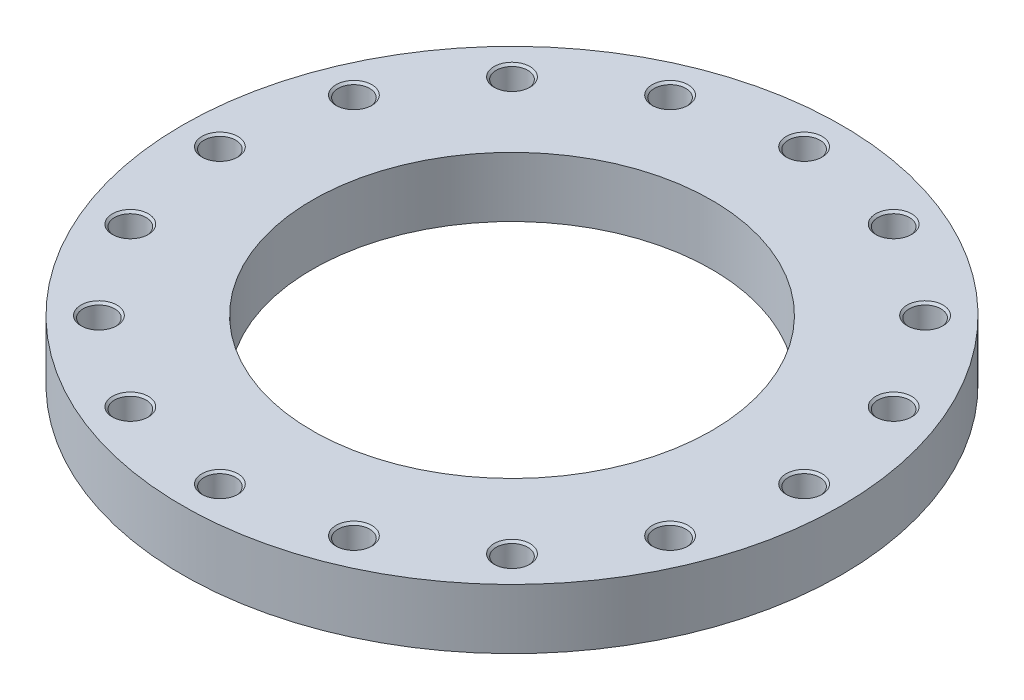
ISO-10303-21;
HEADER;
FILE_DESCRIPTION(('STEP AP214'),'2;1');
FILE_NAME('part.step','',(''),(''),'','','');
FILE_SCHEMA(('AUTOMOTIVE_DESIGN { 1 0 10303 214 1 1 1 1 }'));
ENDSEC;
DATA;
#1=APPLICATION_CONTEXT('core data for automotive mechanical design processes');
#2=APPLICATION_PROTOCOL_DEFINITION('international standard','automotive_design',2000,#1);
#3=PRODUCT_CONTEXT('',#1,'mechanical');
#4=PRODUCT('Part','Part','',(#3));
#5=PRODUCT_RELATED_PRODUCT_CATEGORY('part','',(#4));
#6=PRODUCT_DEFINITION_FORMATION('','',#4);
#7=PRODUCT_DEFINITION_CONTEXT('part definition',#1,'design');
#8=PRODUCT_DEFINITION('design','',#6,#7);
#9=PRODUCT_DEFINITION_SHAPE('','',#8);
#10=(LENGTH_UNIT() NAMED_UNIT(*) SI_UNIT(.MILLI.,.METRE.));
#11=(NAMED_UNIT(*) PLANE_ANGLE_UNIT() SI_UNIT($,.RADIAN.));
#12=(NAMED_UNIT(*) SI_UNIT($,.STERADIAN.) SOLID_ANGLE_UNIT());
#13=UNCERTAINTY_MEASURE_WITH_UNIT(LENGTH_MEASURE(1.E-05),#10,'distance_accuracy_value','');
#14=(GEOMETRIC_REPRESENTATION_CONTEXT(3) GLOBAL_UNCERTAINTY_ASSIGNED_CONTEXT((#13)) GLOBAL_UNIT_ASSIGNED_CONTEXT((#10,
#11,#12)) REPRESENTATION_CONTEXT('',''));
#15=CARTESIAN_POINT('',(0.,0.,0.));
#16=DIRECTION('',(0.,0.,1.));
#17=DIRECTION('',(1.,0.,0.));
#18=AXIS2_PLACEMENT_3D('',#15,#16,#17);
#19=CARTESIAN_POINT('',(0.,30.,0.));
#20=DIRECTION('',(0.,-1.,0.));
#21=DIRECTION('',(1.,0.,0.));
#22=AXIS2_PLACEMENT_3D('',#19,#20,#21);
#23=CYLINDRICAL_SURFACE('',#22,330.);
#24=CARTESIAN_POINT('',(0.,0.,0.));
#25=DIRECTION('',(0.,1.,0.));
#26=DIRECTION('',(1.,0.,0.));
#27=AXIS2_PLACEMENT_3D('',#24,#25,#26);
#28=CIRCLE('',#27,330.);
#29=CARTESIAN_POINT('',(330.,0.,0.));
#30=VERTEX_POINT('',#29);
#31=EDGE_CURVE('E9',#30,#30,#28,.T.);
#32=ORIENTED_EDGE('',*,*,#31,.T.);
#33=EDGE_LOOP('',(#32));
#34=FACE_BOUND('',#33,.T.);
#35=CARTESIAN_POINT('',(0.,60.,0.));
#36=DIRECTION('',(0.,1.,0.));
#37=DIRECTION('',(1.,0.,0.));
#38=AXIS2_PLACEMENT_3D('',#35,#36,#37);
#39=CIRCLE('',#38,330.);
#40=CARTESIAN_POINT('',(330.,60.,0.));
#41=VERTEX_POINT('',#40);
#42=EDGE_CURVE('E75',#41,#41,#39,.T.);
#43=ORIENTED_EDGE('',*,*,#42,.F.);
#44=EDGE_LOOP('',(#43));
#45=FACE_BOUND('',#44,.T.);
#46=ADVANCED_FACE('F15',(#34,#45),#23,.T.);
#47=CARTESIAN_POINT('',(265.,0.,0.));
#48=DIRECTION('',(0.,-1.,0.));
#49=DIRECTION('',(-1.,0.,0.));
#50=AXIS2_PLACEMENT_3D('',#47,#48,#49);
#51=PLANE('',#50);
#52=CARTESIAN_POINT('',(0.,0.,0.));
#53=DIRECTION('',(0.,1.,0.));
#54=DIRECTION('',(1.,0.,0.));
#55=AXIS2_PLACEMENT_3D('',#52,#53,#54);
#56=CIRCLE('',#55,200.);
#57=CARTESIAN_POINT('',(200.,0.,0.));
#58=VERTEX_POINT('',#57);
#59=EDGE_CURVE('E18',#58,#58,#56,.T.);
#60=ORIENTED_EDGE('',*,*,#59,.T.);
#61=EDGE_LOOP('',(#60));
#62=FACE_BOUND('',#61,.T.);
#63=ORIENTED_EDGE('',*,*,#31,.F.);
#64=EDGE_LOOP('',(#63));
#65=FACE_BOUND('',#64,.T.);
#66=ADVANCED_FACE('F626',(#62,#65),#51,.T.);
#67=CARTESIAN_POINT('',(0.,30.,0.));
#68=DIRECTION('',(0.,-1.,0.));
#69=DIRECTION('',(1.,0.,0.));
#70=AXIS2_PLACEMENT_3D('',#67,#68,#69);
#71=CYLINDRICAL_SURFACE('',#70,200.);
#72=CARTESIAN_POINT('',(0.,60.,0.));
#73=DIRECTION('',(0.,1.,0.));
#74=DIRECTION('',(1.,0.,0.));
#75=AXIS2_PLACEMENT_3D('',#72,#73,#74);
#76=CIRCLE('',#75,200.);
#77=CARTESIAN_POINT('',(200.,60.,0.));
#78=VERTEX_POINT('',#77);
#79=EDGE_CURVE('E79',#78,#78,#76,.T.);
#80=ORIENTED_EDGE('',*,*,#79,.T.);
#81=EDGE_LOOP('',(#80));
#82=FACE_BOUND('',#81,.T.);
#83=ORIENTED_EDGE('',*,*,#59,.F.);
#84=EDGE_LOOP('',(#83));
#85=FACE_BOUND('',#84,.T.);
#86=ADVANCED_FACE('F630',(#82,#85),#71,.F.);
#87=CARTESIAN_POINT('',(265.,60.,0.));
#88=DIRECTION('',(0.,1.,0.));
#89=DIRECTION('',(1.,0.,0.));
#90=AXIS2_PLACEMENT_3D('',#87,#88,#89);
#91=PLANE('',#90);
#92=ORIENTED_EDGE('',*,*,#42,.T.);
#93=EDGE_LOOP('',(#92));
#94=FACE_BOUND('',#93,.T.);
#95=ORIENTED_EDGE('',*,*,#79,.F.);
#96=EDGE_LOOP('',(#95));
#97=FACE_BOUND('',#96,.T.);
#98=CARTESIAN_POINT('',(292.5,60.,0.));
#99=DIRECTION('',(0.,-1.,0.));
#100=DIRECTION('',(1.,0.,0.));
#101=AXIS2_PLACEMENT_3D('',#98,#99,#100);
#102=CIRCLE('',#101,18.);
#103=CARTESIAN_POINT('',(310.5,60.,0.));
#104=VERTEX_POINT('',#103);
#105=EDGE_CURVE('E92',#104,#104,#102,.T.);
#106=ORIENTED_EDGE('',*,*,#105,.T.);
#107=EDGE_LOOP('',(#106));
#108=FACE_BOUND('',#107,.T.);
#109=CARTESIAN_POINT('',(270.234763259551,60.,-111.934903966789));
#110=DIRECTION('',(0.,-1.,0.));
#111=DIRECTION('',(0.923879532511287,0.,-0.38268343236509));
#112=AXIS2_PLACEMENT_3D('',#109,#110,#111);
#113=CIRCLE('',#112,18.);
#114=CARTESIAN_POINT('',(286.864594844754,60.,-118.82320574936));
#115=VERTEX_POINT('',#114);
#116=EDGE_CURVE('E101',#115,#115,#113,.T.);
#117=ORIENTED_EDGE('',*,*,#116,.T.);
#118=EDGE_LOOP('',(#117));
#119=FACE_BOUND('',#118,.T.);
#120=CARTESIAN_POINT('',(206.828733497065,60.,-206.828733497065));
#121=DIRECTION('',(0.,-1.,0.));
#122=DIRECTION('',(0.707106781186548,0.,-0.707106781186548));
#123=AXIS2_PLACEMENT_3D('',#120,#121,#122);
#124=CIRCLE('',#123,18.);
#125=CARTESIAN_POINT('',(219.556655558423,60.,-219.556655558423));
#126=VERTEX_POINT('',#125);
#127=EDGE_CURVE('E115',#126,#126,#124,.T.);
#128=ORIENTED_EDGE('',*,*,#127,.T.);
#129=EDGE_LOOP('',(#128));
#130=FACE_BOUND('',#129,.T.);
#131=CARTESIAN_POINT('',(111.934903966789,60.,-270.234763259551));
#132=DIRECTION('',(0.,-1.,0.));
#133=DIRECTION('',(0.38268343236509,0.,-0.923879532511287));
#134=AXIS2_PLACEMENT_3D('',#131,#132,#133);
#135=CIRCLE('',#134,18.);
#136=CARTESIAN_POINT('',(118.82320574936,60.,-286.864594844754));
#137=VERTEX_POINT('',#136);
#138=EDGE_CURVE('E127',#137,#137,#135,.T.);
#139=ORIENTED_EDGE('',*,*,#138,.T.);
#140=EDGE_LOOP('',(#139));
#141=FACE_BOUND('',#140,.T.);
#142=CARTESIAN_POINT('',(0.,60.,-292.5));
#143=DIRECTION('',(0.,-1.,0.));
#144=DIRECTION('',(0.,0.,-1.));
#145=AXIS2_PLACEMENT_3D('',#142,#143,#144);
#146=CIRCLE('',#145,18.);
#147=CARTESIAN_POINT('',(0.,60.,-310.5));
#148=VERTEX_POINT('',#147);
#149=EDGE_CURVE('E141',#148,#148,#146,.T.);
#150=ORIENTED_EDGE('',*,*,#149,.T.);
#151=EDGE_LOOP('',(#150));
#152=FACE_BOUND('',#151,.T.);
#153=CARTESIAN_POINT('',(-111.934903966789,60.,-270.234763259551));
#154=DIRECTION('',(0.,-1.,0.));
#155=DIRECTION('',(-0.38268343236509,0.,-0.923879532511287));
#156=AXIS2_PLACEMENT_3D('',#153,#154,#155);
#157=CIRCLE('',#156,18.);
#158=CARTESIAN_POINT('',(-118.82320574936,60.,-286.864594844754));
#159=VERTEX_POINT('',#158);
#160=EDGE_CURVE('E153',#159,#159,#157,.T.);
#161=ORIENTED_EDGE('',*,*,#160,.T.);
#162=EDGE_LOOP('',(#161));
#163=FACE_BOUND('',#162,.T.);
#164=CARTESIAN_POINT('',(-206.828733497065,60.,-206.828733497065));
#165=DIRECTION('',(0.,-1.,0.));
#166=DIRECTION('',(-0.707106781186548,0.,-0.707106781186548));
#167=AXIS2_PLACEMENT_3D('',#164,#165,#166);
#168=CIRCLE('',#167,18.);
#169=CARTESIAN_POINT('',(-219.556655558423,60.,-219.556655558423));
#170=VERTEX_POINT('',#169);
#171=EDGE_CURVE('E167',#170,#170,#168,.T.);
#172=ORIENTED_EDGE('',*,*,#171,.T.);
#173=EDGE_LOOP('',(#172));
#174=FACE_BOUND('',#173,.T.);
#175=CARTESIAN_POINT('',(-270.234763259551,60.,-111.934903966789));
#176=DIRECTION('',(0.,-1.,0.));
#177=DIRECTION('',(-0.923879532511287,0.,-0.38268343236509));
#178=AXIS2_PLACEMENT_3D('',#175,#176,#177);
#179=CIRCLE('',#178,18.);
#180=CARTESIAN_POINT('',(-286.864594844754,60.,-118.82320574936));
#181=VERTEX_POINT('',#180);
#182=EDGE_CURVE('E185',#181,#181,#179,.T.);
#183=ORIENTED_EDGE('',*,*,#182,.T.);
#184=EDGE_LOOP('',(#183));
#185=FACE_BOUND('',#184,.T.);
#186=CARTESIAN_POINT('',(-292.5,60.,0.));
#187=DIRECTION('',(0.,-1.,0.));
#188=DIRECTION('',(-1.,0.,0.));
#189=AXIS2_PLACEMENT_3D('',#186,#187,#188);
#190=CIRCLE('',#189,18.);
#191=CARTESIAN_POINT('',(-310.5,60.,0.));
#192=VERTEX_POINT('',#191);
#193=EDGE_CURVE('E204',#192,#192,#190,.T.);
#194=ORIENTED_EDGE('',*,*,#193,.T.);
#195=EDGE_LOOP('',(#194));
#196=FACE_BOUND('',#195,.T.);
#197=CARTESIAN_POINT('',(-270.234763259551,60.,111.934903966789));
#198=DIRECTION('',(0.,-1.,0.));
#199=DIRECTION('',(-0.923879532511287,0.,0.38268343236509));
#200=AXIS2_PLACEMENT_3D('',#197,#198,#199);
#201=CIRCLE('',#200,18.);
#202=CARTESIAN_POINT('',(-286.864594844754,60.,118.82320574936));
#203=VERTEX_POINT('',#202);
#204=EDGE_CURVE('E226',#203,#203,#201,.T.);
#205=ORIENTED_EDGE('',*,*,#204,.T.);
#206=EDGE_LOOP('',(#205));
#207=FACE_BOUND('',#206,.T.);
#208=CARTESIAN_POINT('',(-206.828733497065,60.,206.828733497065));
#209=DIRECTION('',(0.,-1.,0.));
#210=DIRECTION('',(-0.707106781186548,0.,0.707106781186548));
#211=AXIS2_PLACEMENT_3D('',#208,#209,#210);
#212=CIRCLE('',#211,18.);
#213=CARTESIAN_POINT('',(-219.556655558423,60.,219.556655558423));
#214=VERTEX_POINT('',#213);
#215=EDGE_CURVE('E248',#214,#214,#212,.T.);
#216=ORIENTED_EDGE('',*,*,#215,.T.);
#217=EDGE_LOOP('',(#216));
#218=FACE_BOUND('',#217,.T.);
#219=CARTESIAN_POINT('',(-111.934903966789,60.,270.234763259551));
#220=DIRECTION('',(0.,-1.,0.));
#221=DIRECTION('',(-0.382683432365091,0.,0.923879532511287));
#222=AXIS2_PLACEMENT_3D('',#219,#220,#221);
#223=CIRCLE('',#222,18.);
#224=CARTESIAN_POINT('',(-118.82320574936,60.,286.864594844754));
#225=VERTEX_POINT('',#224);
#226=EDGE_CURVE('E264',#225,#225,#223,.T.);
#227=ORIENTED_EDGE('',*,*,#226,.T.);
#228=EDGE_LOOP('',(#227));
#229=FACE_BOUND('',#228,.T.);
#230=CARTESIAN_POINT('',(0.,60.,292.5));
#231=DIRECTION('',(0.,-1.,0.));
#232=DIRECTION('',(0.,0.,1.));
#233=AXIS2_PLACEMENT_3D('',#230,#231,#232);
#234=CIRCLE('',#233,18.);
#235=CARTESIAN_POINT('',(0.,60.,310.5));
#236=VERTEX_POINT('',#235);
#237=EDGE_CURVE('E283',#236,#236,#234,.T.);
#238=ORIENTED_EDGE('',*,*,#237,.T.);
#239=EDGE_LOOP('',(#238));
#240=FACE_BOUND('',#239,.T.);
#241=CARTESIAN_POINT('',(111.934903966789,60.,270.234763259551));
#242=DIRECTION('',(0.,-1.,0.));
#243=DIRECTION('',(0.38268343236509,0.,0.923879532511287));
#244=AXIS2_PLACEMENT_3D('',#241,#242,#243);
#245=CIRCLE('',#244,18.);
#246=CARTESIAN_POINT('',(118.82320574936,60.,286.864594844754));
#247=VERTEX_POINT('',#246);
#248=EDGE_CURVE('E303',#247,#247,#245,.T.);
#249=ORIENTED_EDGE('',*,*,#248,.T.);
#250=EDGE_LOOP('',(#249));
#251=FACE_BOUND('',#250,.T.);
#252=CARTESIAN_POINT('',(206.828733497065,60.,206.828733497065));
#253=DIRECTION('',(0.,-1.,0.));
#254=DIRECTION('',(0.707106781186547,0.,0.707106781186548));
#255=AXIS2_PLACEMENT_3D('',#252,#253,#254);
#256=CIRCLE('',#255,18.);
#257=CARTESIAN_POINT('',(219.556655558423,60.,219.556655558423));
#258=VERTEX_POINT('',#257);
#259=EDGE_CURVE('E320',#258,#258,#256,.T.);
#260=ORIENTED_EDGE('',*,*,#259,.T.);
#261=EDGE_LOOP('',(#260));
#262=FACE_BOUND('',#261,.T.);
#263=CARTESIAN_POINT('',(270.234763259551,60.,111.934903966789));
#264=DIRECTION('',(0.,-1.,0.));
#265=DIRECTION('',(0.923879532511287,0.,0.382683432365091));
#266=AXIS2_PLACEMENT_3D('',#263,#264,#265);
#267=CIRCLE('',#266,18.);
#268=CARTESIAN_POINT('',(286.864594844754,60.,118.823205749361));
#269=VERTEX_POINT('',#268);
#270=EDGE_CURVE('E342',#269,#269,#267,.T.);
#271=ORIENTED_EDGE('',*,*,#270,.T.);
#272=EDGE_LOOP('',(#271));
#273=FACE_BOUND('',#272,.T.);
#274=ADVANCED_FACE('F76',(#94,#97,#108,#119,#130,#141,#152,#163,#174,#185,#196,#207,#218,#229,
#240,#251,#262,#273),#91,.T.);
#275=CARTESIAN_POINT('',(292.5,8.42882924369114,0.));
#276=DIRECTION('',(0.,1.,0.));
#277=DIRECTION('',(1.,0.,0.));
#278=AXIS2_PLACEMENT_3D('',#275,#276,#277);
#279=CONICAL_SURFACE('',#278,7.9175,1.0471975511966);
#280=CARTESIAN_POINT('',(292.5,13.,0.));
#281=DIRECTION('',(0.,-1.,0.));
#282=DIRECTION('',(1.,0.,0.));
#283=AXIS2_PLACEMENT_3D('',#280,#281,#282);
#284=CIRCLE('',#283,15.835);
#285=CARTESIAN_POINT('',(308.335,13.,0.));
#286=VERTEX_POINT('',#285);
#287=EDGE_CURVE('E80',#286,#286,#284,.T.);
#288=ORIENTED_EDGE('',*,*,#287,.F.);
#289=EDGE_LOOP('',(#288));
#290=FACE_BOUND('',#289,.T.);
#291=CARTESIAN_POINT('',(292.5,3.85765848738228,0.));
#292=VERTEX_POINT('',#291);
#293=VERTEX_LOOP('',#292);
#294=FACE_BOUND('',#293,.T.);
#295=ADVANCED_FACE('F643',(#290,#294),#279,.F.);
#296=CARTESIAN_POINT('',(292.5,17.9175,0.));
#297=DIRECTION('',(0.,1.,0.));
#298=DIRECTION('',(1.,0.,0.));
#299=AXIS2_PLACEMENT_3D('',#296,#297,#298);
#300=CYLINDRICAL_SURFACE('',#299,15.835);
#301=CARTESIAN_POINT('',(292.5,22.835,0.));
#302=DIRECTION('',(0.,-1.,0.));
#303=DIRECTION('',(1.,0.,0.));
#304=AXIS2_PLACEMENT_3D('',#301,#302,#303);
#305=CIRCLE('',#304,15.835);
#306=CARTESIAN_POINT('',(308.335,22.835,0.));
#307=VERTEX_POINT('',#306);
#308=EDGE_CURVE('E85',#307,#307,#305,.T.);
#309=ORIENTED_EDGE('',*,*,#308,.F.);
#310=EDGE_LOOP('',(#309));
#311=FACE_BOUND('',#310,.T.);
#312=ORIENTED_EDGE('',*,*,#287,.T.);
#313=EDGE_LOOP('',(#312));
#314=FACE_BOUND('',#313,.T.);
#315=ADVANCED_FACE('F639',(#311,#314),#300,.F.);
#316=CARTESIAN_POINT('',(292.5,23.9175,0.));
#317=DIRECTION('',(0.,1.,0.));
#318=DIRECTION('',(1.,0.,0.));
#319=AXIS2_PLACEMENT_3D('',#316,#317,#318);
#320=CONICAL_SURFACE('',#319,16.9175,0.785398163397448);
#321=CARTESIAN_POINT('',(292.5,25.,0.));
#322=DIRECTION('',(0.,-1.,0.));
#323=DIRECTION('',(1.,0.,0.));
#324=AXIS2_PLACEMENT_3D('',#321,#322,#323);
#325=CIRCLE('',#324,18.);
#326=CARTESIAN_POINT('',(310.5,25.,0.));
#327=VERTEX_POINT('',#326);
#328=EDGE_CURVE('E88',#327,#327,#325,.T.);
#329=ORIENTED_EDGE('',*,*,#328,.F.);
#330=EDGE_LOOP('',(#329));
#331=FACE_BOUND('',#330,.T.);
#332=ORIENTED_EDGE('',*,*,#308,.T.);
#333=EDGE_LOOP('',(#332));
#334=FACE_BOUND('',#333,.T.);
#335=ADVANCED_FACE('F642',(#331,#334),#320,.F.);
#336=CARTESIAN_POINT('',(309.4175,25.,0.));
#337=DIRECTION('',(0.,1.,0.));
#338=DIRECTION('',(-1.,0.,0.));
#339=AXIS2_PLACEMENT_3D('',#336,#337,#338);
#340=PLANE('',#339);
#341=CARTESIAN_POINT('',(292.5,25.,0.));
#342=DIRECTION('',(0.,-1.,0.));
#343=DIRECTION('',(1.,0.,0.));
#344=AXIS2_PLACEMENT_3D('',#341,#342,#343);
#345=CIRCLE('',#344,15.835);
#346=CARTESIAN_POINT('',(308.335,25.,0.));
#347=VERTEX_POINT('',#346);
#348=EDGE_CURVE('E90',#347,#347,#345,.T.);
#349=ORIENTED_EDGE('',*,*,#348,.F.);
#350=EDGE_LOOP('',(#349));
#351=FACE_BOUND('',#350,.T.);
#352=ORIENTED_EDGE('',*,*,#328,.T.);
#353=EDGE_LOOP('',(#352));
#354=FACE_BOUND('',#353,.T.);
#355=ADVANCED_FACE('F647',(#351,#354),#340,.F.);
#356=CARTESIAN_POINT('',(292.5,41.4175,0.));
#357=DIRECTION('',(0.,1.,0.));
#358=DIRECTION('',(1.,0.,0.));
#359=AXIS2_PLACEMENT_3D('',#356,#357,#358);
#360=CYLINDRICAL_SURFACE('',#359,15.835);
#361=CARTESIAN_POINT('',(292.5,57.835,0.));
#362=DIRECTION('',(0.,-1.,0.));
#363=DIRECTION('',(1.,0.,0.));
#364=AXIS2_PLACEMENT_3D('',#361,#362,#363);
#365=CIRCLE('',#364,15.835);
#366=CARTESIAN_POINT('',(308.335,57.835,0.));
#367=VERTEX_POINT('',#366);
#368=EDGE_CURVE('E93',#367,#367,#365,.T.);
#369=ORIENTED_EDGE('',*,*,#368,.F.);
#370=EDGE_LOOP('',(#369));
#371=FACE_BOUND('',#370,.T.);
#372=ORIENTED_EDGE('',*,*,#348,.T.);
#373=EDGE_LOOP('',(#372));
#374=FACE_BOUND('',#373,.T.);
#375=ADVANCED_FACE('F649',(#371,#374),#360,.F.);
#376=CARTESIAN_POINT('',(292.5,58.9175,0.));
#377=DIRECTION('',(0.,1.,0.));
#378=DIRECTION('',(1.,0.,0.));
#379=AXIS2_PLACEMENT_3D('',#376,#377,#378);
#380=CONICAL_SURFACE('',#379,16.9175,0.785398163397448);
#381=ORIENTED_EDGE('',*,*,#105,.F.);
#382=EDGE_LOOP('',(#381));
#383=FACE_BOUND('',#382,.T.);
#384=ORIENTED_EDGE('',*,*,#368,.T.);
#385=EDGE_LOOP('',(#384));
#386=FACE_BOUND('',#385,.T.);
#387=ADVANCED_FACE('F652',(#383,#386),#380,.F.);
#388=CARTESIAN_POINT('',(270.234763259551,8.42882924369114,-111.934903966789));
#389=DIRECTION('',(0.,1.,0.));
#390=DIRECTION('',(0.923879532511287,0.,-0.38268343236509));
#391=AXIS2_PLACEMENT_3D('',#388,#389,#390);
#392=CONICAL_SURFACE('',#391,7.9175,1.0471975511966);
#393=CARTESIAN_POINT('',(270.234763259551,13.,-111.934903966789));
#394=DIRECTION('',(0.,-1.,0.));
#395=DIRECTION('',(0.923879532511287,0.,-0.38268343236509));
#396=AXIS2_PLACEMENT_3D('',#393,#394,#395);
#397=CIRCLE('',#396,15.835);
#398=CARTESIAN_POINT('',(284.864395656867,13.,-117.99469611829));
#399=VERTEX_POINT('',#398);
#400=EDGE_CURVE('E96',#399,#399,#397,.T.);
#401=ORIENTED_EDGE('',*,*,#400,.F.);
#402=EDGE_LOOP('',(#401));
#403=FACE_BOUND('',#402,.T.);
#404=CARTESIAN_POINT('',(270.234763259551,3.85765848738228,-111.934903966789));
#405=VERTEX_POINT('',#404);
#406=VERTEX_LOOP('',#405);
#407=FACE_BOUND('',#406,.T.);
#408=ADVANCED_FACE('F654',(#403,#407),#392,.F.);
#409=CARTESIAN_POINT('',(270.234763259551,17.9175,-111.934903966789));
#410=DIRECTION('',(0.,1.,0.));
#411=DIRECTION('',(0.923879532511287,0.,-0.38268343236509));
#412=AXIS2_PLACEMENT_3D('',#409,#410,#411);
#413=CYLINDRICAL_SURFACE('',#412,15.835);
#414=CARTESIAN_POINT('',(270.234763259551,22.835,-111.934903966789));
#415=DIRECTION('',(0.,-1.,0.));
#416=DIRECTION('',(0.923879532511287,0.,-0.38268343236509));
#417=AXIS2_PLACEMENT_3D('',#414,#415,#416);
#418=CIRCLE('',#417,15.835);
#419=CARTESIAN_POINT('',(284.864395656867,22.835,-117.99469611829));
#420=VERTEX_POINT('',#419);
#421=EDGE_CURVE('E97',#420,#420,#418,.T.);
#422=ORIENTED_EDGE('',*,*,#421,.F.);
#423=EDGE_LOOP('',(#422));
#424=FACE_BOUND('',#423,.T.);
#425=ORIENTED_EDGE('',*,*,#400,.T.);
#426=EDGE_LOOP('',(#425));
#427=FACE_BOUND('',#426,.T.);
#428=ADVANCED_FACE('F657',(#424,#427),#413,.F.);
#429=CARTESIAN_POINT('',(270.234763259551,23.9175,-111.934903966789));
#430=DIRECTION('',(0.,1.,0.));
#431=DIRECTION('',(0.923879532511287,0.,-0.38268343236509));
#432=AXIS2_PLACEMENT_3D('',#429,#430,#431);
#433=CONICAL_SURFACE('',#432,16.9175,0.785398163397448);
#434=CARTESIAN_POINT('',(270.234763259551,25.,-111.934903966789));
#435=DIRECTION('',(0.,-1.,0.));
#436=DIRECTION('',(0.923879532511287,0.,-0.38268343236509));
#437=AXIS2_PLACEMENT_3D('',#434,#435,#436);
#438=CIRCLE('',#437,18.);
#439=CARTESIAN_POINT('',(286.864594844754,25.,-118.82320574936));
#440=VERTEX_POINT('',#439);
#441=EDGE_CURVE('E100',#440,#440,#438,.T.);
#442=ORIENTED_EDGE('',*,*,#441,.F.);
#443=EDGE_LOOP('',(#442));
#444=FACE_BOUND('',#443,.T.);
#445=ORIENTED_EDGE('',*,*,#421,.T.);
#446=EDGE_LOOP('',(#445));
#447=FACE_BOUND('',#446,.T.);
#448=ADVANCED_FACE('F661',(#444,#447),#433,.F.);
#449=CARTESIAN_POINT('',(285.864495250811,25.,-118.408950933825));
#450=DIRECTION('',(0.,1.,0.));
#451=DIRECTION('',(-0.923879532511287,0.,0.38268343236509));
#452=AXIS2_PLACEMENT_3D('',#449,#450,#451);
#453=PLANE('',#452);
#454=CARTESIAN_POINT('',(270.234763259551,25.,-111.934903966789));
#455=DIRECTION('',(0.,-1.,0.));
#456=DIRECTION('',(0.923879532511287,0.,-0.38268343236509));
#457=AXIS2_PLACEMENT_3D('',#454,#455,#456);
#458=CIRCLE('',#457,15.835);
#459=CARTESIAN_POINT('',(284.864395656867,25.,-117.99469611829));
#460=VERTEX_POINT('',#459);
#461=EDGE_CURVE('E103',#460,#460,#458,.T.);
#462=ORIENTED_EDGE('',*,*,#461,.F.);
#463=EDGE_LOOP('',(#462));
#464=FACE_BOUND('',#463,.T.);
#465=ORIENTED_EDGE('',*,*,#441,.T.);
#466=EDGE_LOOP('',(#465));
#467=FACE_BOUND('',#466,.T.);
#468=ADVANCED_FACE('F664',(#464,#467),#453,.F.);
#469=CARTESIAN_POINT('',(270.234763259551,41.4175,-111.934903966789));
#470=DIRECTION('',(0.,1.,0.));
#471=DIRECTION('',(0.923879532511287,0.,-0.38268343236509));
#472=AXIS2_PLACEMENT_3D('',#469,#470,#471);
#473=CYLINDRICAL_SURFACE('',#472,15.835);
#474=CARTESIAN_POINT('',(270.234763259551,57.835,-111.934903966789));
#475=DIRECTION('',(0.,-1.,0.));
#476=DIRECTION('',(0.923879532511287,0.,-0.38268343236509));
#477=AXIS2_PLACEMENT_3D('',#474,#475,#476);
#478=CIRCLE('',#477,15.835);
#479=CARTESIAN_POINT('',(284.864395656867,57.835,-117.99469611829));
#480=VERTEX_POINT('',#479);
#481=EDGE_CURVE('E104',#480,#480,#478,.T.);
#482=ORIENTED_EDGE('',*,*,#481,.F.);
#483=EDGE_LOOP('',(#482));
#484=FACE_BOUND('',#483,.T.);
#485=ORIENTED_EDGE('',*,*,#461,.T.);
#486=EDGE_LOOP('',(#485));
#487=FACE_BOUND('',#486,.T.);
#488=ADVANCED_FACE('F621',(#484,#487),#473,.F.);
#489=CARTESIAN_POINT('',(270.234763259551,58.9175,-111.934903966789));
#490=DIRECTION('',(0.,1.,0.));
#491=DIRECTION('',(0.923879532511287,0.,-0.38268343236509));
#492=AXIS2_PLACEMENT_3D('',#489,#490,#491);
#493=CONICAL_SURFACE('',#492,16.9175,0.785398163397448);
#494=ORIENTED_EDGE('',*,*,#116,.F.);
#495=EDGE_LOOP('',(#494));
#496=FACE_BOUND('',#495,.T.);
#497=ORIENTED_EDGE('',*,*,#481,.T.);
#498=EDGE_LOOP('',(#497));
#499=FACE_BOUND('',#498,.T.);
#500=ADVANCED_FACE('F615',(#496,#499),#493,.F.);
#501=CARTESIAN_POINT('',(206.828733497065,8.42882924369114,-206.828733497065));
#502=DIRECTION('',(0.,1.,0.));
#503=DIRECTION('',(0.707106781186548,0.,-0.707106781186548));
#504=AXIS2_PLACEMENT_3D('',#501,#502,#503);
#505=CONICAL_SURFACE('',#504,7.9175,1.0471975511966);
#506=CARTESIAN_POINT('',(206.828733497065,13.,-206.828733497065));
#507=DIRECTION('',(0.,-1.,0.));
#508=DIRECTION('',(0.707106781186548,0.,-0.707106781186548));
#509=AXIS2_PLACEMENT_3D('',#506,#507,#508);
#510=CIRCLE('',#509,15.835);
#511=CARTESIAN_POINT('',(218.025769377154,13.,-218.025769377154));
#512=VERTEX_POINT('',#511);
#513=EDGE_CURVE('E106',#512,#512,#510,.T.);
#514=ORIENTED_EDGE('',*,*,#513,.F.);
#515=EDGE_LOOP('',(#514));
#516=FACE_BOUND('',#515,.T.);
#517=CARTESIAN_POINT('',(206.828733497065,3.85765848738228,-206.828733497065));
#518=VERTEX_POINT('',#517);
#519=VERTEX_LOOP('',#518);
#520=FACE_BOUND('',#519,.T.);
#521=ADVANCED_FACE('F609',(#516,#520),#505,.F.);
#522=CARTESIAN_POINT('',(206.828733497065,17.9175,-206.828733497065));
#523=DIRECTION('',(0.,1.,0.));
#524=DIRECTION('',(0.707106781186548,0.,-0.707106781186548));
#525=AXIS2_PLACEMENT_3D('',#522,#523,#524);
#526=CYLINDRICAL_SURFACE('',#525,15.835);
#527=CARTESIAN_POINT('',(206.828733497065,22.835,-206.828733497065));
#528=DIRECTION('',(0.,-1.,0.));
#529=DIRECTION('',(0.707106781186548,0.,-0.707106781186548));
#530=AXIS2_PLACEMENT_3D('',#527,#528,#529);
#531=CIRCLE('',#530,15.835);
#532=CARTESIAN_POINT('',(218.025769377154,22.835,-218.025769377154));
#533=VERTEX_POINT('',#532);
#534=EDGE_CURVE('E108',#533,#533,#531,.T.);
#535=ORIENTED_EDGE('',*,*,#534,.F.);
#536=EDGE_LOOP('',(#535));
#537=FACE_BOUND('',#536,.T.);
#538=ORIENTED_EDGE('',*,*,#513,.T.);
#539=EDGE_LOOP('',(#538));
#540=FACE_BOUND('',#539,.T.);
#541=ADVANCED_FACE('F603',(#537,#540),#526,.F.);
#542=CARTESIAN_POINT('',(206.828733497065,23.9175,-206.828733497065));
#543=DIRECTION('',(0.,1.,0.));
#544=DIRECTION('',(0.707106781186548,0.,-0.707106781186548));
#545=AXIS2_PLACEMENT_3D('',#542,#543,#544);
#546=CONICAL_SURFACE('',#545,16.9175,0.785398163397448);
#547=CARTESIAN_POINT('',(206.828733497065,25.,-206.828733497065));
#548=DIRECTION('',(0.,-1.,0.));
#549=DIRECTION('',(0.707106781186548,0.,-0.707106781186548));
#550=AXIS2_PLACEMENT_3D('',#547,#548,#549);
#551=CIRCLE('',#550,18.);
#552=CARTESIAN_POINT('',(219.556655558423,25.,-219.556655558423));
#553=VERTEX_POINT('',#552);
#554=EDGE_CURVE('E111',#553,#553,#551,.T.);
#555=ORIENTED_EDGE('',*,*,#554,.F.);
#556=EDGE_LOOP('',(#555));
#557=FACE_BOUND('',#556,.T.);
#558=ORIENTED_EDGE('',*,*,#534,.T.);
#559=EDGE_LOOP('',(#558));
#560=FACE_BOUND('',#559,.T.);
#561=ADVANCED_FACE('F597',(#557,#560),#546,.F.);
#562=CARTESIAN_POINT('',(218.791212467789,25.,-218.791212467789));
#563=DIRECTION('',(0.,1.,0.));
#564=DIRECTION('',(-0.707106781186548,0.,0.707106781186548));
#565=AXIS2_PLACEMENT_3D('',#562,#563,#564);
#566=PLANE('',#565);
#567=CARTESIAN_POINT('',(206.828733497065,25.,-206.828733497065));
#568=DIRECTION('',(0.,-1.,0.));
#569=DIRECTION('',(0.707106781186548,0.,-0.707106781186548));
#570=AXIS2_PLACEMENT_3D('',#567,#568,#569);
#571=CIRCLE('',#570,15.835);
#572=CARTESIAN_POINT('',(218.025769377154,25.,-218.025769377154));
#573=VERTEX_POINT('',#572);
#574=EDGE_CURVE('E112',#573,#573,#571,.T.);
#575=ORIENTED_EDGE('',*,*,#574,.F.);
#576=EDGE_LOOP('',(#575));
#577=FACE_BOUND('',#576,.T.);
#578=ORIENTED_EDGE('',*,*,#554,.T.);
#579=EDGE_LOOP('',(#578));
#580=FACE_BOUND('',#579,.T.);
#581=ADVANCED_FACE('F591',(#577,#580),#566,.F.);
#582=CARTESIAN_POINT('',(206.828733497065,41.4175,-206.828733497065));
#583=DIRECTION('',(0.,1.,0.));
#584=DIRECTION('',(0.707106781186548,0.,-0.707106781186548));
#585=AXIS2_PLACEMENT_3D('',#582,#583,#584);
#586=CYLINDRICAL_SURFACE('',#585,15.835);
#587=CARTESIAN_POINT('',(206.828733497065,57.835,-206.828733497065));
#588=DIRECTION('',(0.,-1.,0.));
#589=DIRECTION('',(0.707106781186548,0.,-0.707106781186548));
#590=AXIS2_PLACEMENT_3D('',#587,#588,#589);
#591=CIRCLE('',#590,15.835);
#592=CARTESIAN_POINT('',(218.025769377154,57.835,-218.025769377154));
#593=VERTEX_POINT('',#592);
#594=EDGE_CURVE('E116',#593,#593,#591,.T.);
#595=ORIENTED_EDGE('',*,*,#594,.F.);
#596=EDGE_LOOP('',(#595));
#597=FACE_BOUND('',#596,.T.);
#598=ORIENTED_EDGE('',*,*,#574,.T.);
#599=EDGE_LOOP('',(#598));
#600=FACE_BOUND('',#599,.T.);
#601=ADVANCED_FACE('F588',(#597,#600),#586,.F.);
#602=CARTESIAN_POINT('',(206.828733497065,58.9175,-206.828733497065));
#603=DIRECTION('',(0.,1.,0.));
#604=DIRECTION('',(0.707106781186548,0.,-0.707106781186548));
#605=AXIS2_PLACEMENT_3D('',#602,#603,#604);
#606=CONICAL_SURFACE('',#605,16.9175,0.785398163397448);
#607=ORIENTED_EDGE('',*,*,#127,.F.);
#608=EDGE_LOOP('',(#607));
#609=FACE_BOUND('',#608,.T.);
#610=ORIENTED_EDGE('',*,*,#594,.T.);
#611=EDGE_LOOP('',(#610));
#612=FACE_BOUND('',#611,.T.);
#613=ADVANCED_FACE('F586',(#609,#612),#606,.F.);
#614=CARTESIAN_POINT('',(111.934903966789,8.42882924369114,-270.234763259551));
#615=DIRECTION('',(0.,1.,0.));
#616=DIRECTION('',(0.38268343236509,0.,-0.923879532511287));
#617=AXIS2_PLACEMENT_3D('',#614,#615,#616);
#618=CONICAL_SURFACE('',#617,7.9175,1.0471975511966);
#619=CARTESIAN_POINT('',(111.934903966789,13.,-270.234763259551));
#620=DIRECTION('',(0.,-1.,0.));
#621=DIRECTION('',(0.38268343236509,0.,-0.923879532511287));
#622=AXIS2_PLACEMENT_3D('',#619,#620,#621);
#623=CIRCLE('',#622,15.835);
#624=CARTESIAN_POINT('',(117.99469611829,13.,-284.864395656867));
#625=VERTEX_POINT('',#624);
#626=EDGE_CURVE('E119',#625,#625,#623,.T.);
#627=ORIENTED_EDGE('',*,*,#626,.F.);
#628=EDGE_LOOP('',(#627));
#629=FACE_BOUND('',#628,.T.);
#630=CARTESIAN_POINT('',(111.934903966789,3.85765848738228,-270.234763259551));
#631=VERTEX_POINT('',#630);
#632=VERTEX_LOOP('',#631);
#633=FACE_BOUND('',#632,.T.);
#634=ADVANCED_FACE('F763',(#629,#633),#618,.F.);
#635=CARTESIAN_POINT('',(111.934903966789,17.9175,-270.234763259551));
#636=DIRECTION('',(0.,1.,0.));
#637=DIRECTION('',(0.38268343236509,0.,-0.923879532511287));
#638=AXIS2_PLACEMENT_3D('',#635,#636,#637);
#639=CYLINDRICAL_SURFACE('',#638,15.835);
#640=CARTESIAN_POINT('',(111.934903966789,22.835,-270.234763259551));
#641=DIRECTION('',(0.,-1.,0.));
#642=DIRECTION('',(0.38268343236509,0.,-0.923879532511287));
#643=AXIS2_PLACEMENT_3D('',#640,#641,#642);
#644=CIRCLE('',#643,15.835);
#645=CARTESIAN_POINT('',(117.99469611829,22.835,-284.864395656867));
#646=VERTEX_POINT('',#645);
#647=EDGE_CURVE('E122',#646,#646,#644,.T.);
#648=ORIENTED_EDGE('',*,*,#647,.F.);
#649=EDGE_LOOP('',(#648));
#650=FACE_BOUND('',#649,.T.);
#651=ORIENTED_EDGE('',*,*,#626,.T.);
#652=EDGE_LOOP('',(#651));
#653=FACE_BOUND('',#652,.T.);
#654=ADVANCED_FACE('F760',(#650,#653),#639,.F.);
#655=CARTESIAN_POINT('',(111.934903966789,23.9175,-270.234763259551));
#656=DIRECTION('',(0.,1.,0.));
#657=DIRECTION('',(0.38268343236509,0.,-0.923879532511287));
#658=AXIS2_PLACEMENT_3D('',#655,#656,#657);
#659=CONICAL_SURFACE('',#658,16.9175,0.785398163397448);
#660=CARTESIAN_POINT('',(111.934903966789,25.,-270.234763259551));
#661=DIRECTION('',(0.,-1.,0.));
#662=DIRECTION('',(0.38268343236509,0.,-0.923879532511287));
#663=AXIS2_PLACEMENT_3D('',#660,#661,#662);
#664=CIRCLE('',#663,18.);
#665=CARTESIAN_POINT('',(118.82320574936,25.,-286.864594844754));
#666=VERTEX_POINT('',#665);
#667=EDGE_CURVE('E123',#666,#666,#664,.T.);
#668=ORIENTED_EDGE('',*,*,#667,.F.);
#669=EDGE_LOOP('',(#668));
#670=FACE_BOUND('',#669,.T.);
#671=ORIENTED_EDGE('',*,*,#647,.T.);
#672=EDGE_LOOP('',(#671));
#673=FACE_BOUND('',#672,.T.);
#674=ADVANCED_FACE('F758',(#670,#673),#659,.F.);
#675=CARTESIAN_POINT('',(118.408950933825,25.,-285.864495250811));
#676=DIRECTION('',(0.,1.,0.));
#677=DIRECTION('',(-0.38268343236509,0.,0.923879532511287));
#678=AXIS2_PLACEMENT_3D('',#675,#676,#677);
#679=PLANE('',#678);
#680=CARTESIAN_POINT('',(111.934903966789,25.,-270.234763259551));
#681=DIRECTION('',(0.,-1.,0.));
#682=DIRECTION('',(0.38268343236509,0.,-0.923879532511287));
#683=AXIS2_PLACEMENT_3D('',#680,#681,#682);
#684=CIRCLE('',#683,15.835);
#685=CARTESIAN_POINT('',(117.99469611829,25.,-284.864395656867));
#686=VERTEX_POINT('',#685);
#687=EDGE_CURVE('E126',#686,#686,#684,.T.);
#688=ORIENTED_EDGE('',*,*,#687,.F.);
#689=EDGE_LOOP('',(#688));
#690=FACE_BOUND('',#689,.T.);
#691=ORIENTED_EDGE('',*,*,#667,.T.);
#692=EDGE_LOOP('',(#691));
#693=FACE_BOUND('',#692,.T.);
#694=ADVANCED_FACE('F754',(#690,#693),#679,.F.);
#695=CARTESIAN_POINT('',(111.934903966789,41.4175,-270.234763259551));
#696=DIRECTION('',(0.,1.,0.));
#697=DIRECTION('',(0.38268343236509,0.,-0.923879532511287));
#698=AXIS2_PLACEMENT_3D('',#695,#696,#697);
#699=CYLINDRICAL_SURFACE('',#698,15.835);
#700=CARTESIAN_POINT('',(111.934903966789,57.835,-270.234763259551));
#701=DIRECTION('',(0.,-1.,0.));
#702=DIRECTION('',(0.38268343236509,0.,-0.923879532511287));
#703=AXIS2_PLACEMENT_3D('',#700,#701,#702);
#704=CIRCLE('',#703,15.835);
#705=CARTESIAN_POINT('',(117.99469611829,57.835,-284.864395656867));
#706=VERTEX_POINT('',#705);
#707=EDGE_CURVE('E130',#706,#706,#704,.T.);
#708=ORIENTED_EDGE('',*,*,#707,.F.);
#709=EDGE_LOOP('',(#708));
#710=FACE_BOUND('',#709,.T.);
#711=ORIENTED_EDGE('',*,*,#687,.T.);
#712=EDGE_LOOP('',(#711));
#713=FACE_BOUND('',#712,.T.);
#714=ADVANCED_FACE('F747',(#710,#713),#699,.F.);
#715=CARTESIAN_POINT('',(111.934903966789,58.9175,-270.234763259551));
#716=DIRECTION('',(0.,1.,0.));
#717=DIRECTION('',(0.38268343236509,0.,-0.923879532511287));
#718=AXIS2_PLACEMENT_3D('',#715,#716,#717);
#719=CONICAL_SURFACE('',#718,16.9175,0.785398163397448);
#720=ORIENTED_EDGE('',*,*,#138,.F.);
#721=EDGE_LOOP('',(#720));
#722=FACE_BOUND('',#721,.T.);
#723=ORIENTED_EDGE('',*,*,#707,.T.);
#724=EDGE_LOOP('',(#723));
#725=FACE_BOUND('',#724,.T.);
#726=ADVANCED_FACE('F742',(#722,#725),#719,.F.);
#727=CARTESIAN_POINT('',(0.,8.42882924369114,-292.5));
#728=DIRECTION('',(0.,1.,0.));
#729=DIRECTION('',(0.,0.,-1.));
#730=AXIS2_PLACEMENT_3D('',#727,#728,#729);
#731=CONICAL_SURFACE('',#730,7.9175,1.0471975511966);
#732=CARTESIAN_POINT('',(0.,13.,-292.5));
#733=DIRECTION('',(0.,-1.,0.));
#734=DIRECTION('',(0.,0.,-1.));
#735=AXIS2_PLACEMENT_3D('',#732,#733,#734);
#736=CIRCLE('',#735,15.835);
#737=CARTESIAN_POINT('',(0.,13.,-308.335));
#738=VERTEX_POINT('',#737);
#739=EDGE_CURVE('E133',#738,#738,#736,.T.);
#740=ORIENTED_EDGE('',*,*,#739,.F.);
#741=EDGE_LOOP('',(#740));
#742=FACE_BOUND('',#741,.T.);
#743=CARTESIAN_POINT('',(0.,3.85765848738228,-292.5));
#744=VERTEX_POINT('',#743);
#745=VERTEX_LOOP('',#744);
#746=FACE_BOUND('',#745,.T.);
#747=ADVANCED_FACE('F736',(#742,#746),#731,.F.);
#748=CARTESIAN_POINT('',(0.,17.9175,-292.5));
#749=DIRECTION('',(0.,1.,0.));
#750=DIRECTION('',(0.,0.,-1.));
#751=AXIS2_PLACEMENT_3D('',#748,#749,#750);
#752=CYLINDRICAL_SURFACE('',#751,15.835);
#753=CARTESIAN_POINT('',(0.,22.835,-292.5));
#754=DIRECTION('',(0.,-1.,0.));
#755=DIRECTION('',(0.,0.,-1.));
#756=AXIS2_PLACEMENT_3D('',#753,#754,#755);
#757=CIRCLE('',#756,15.835);
#758=CARTESIAN_POINT('',(0.,22.835,-308.335));
#759=VERTEX_POINT('',#758);
#760=EDGE_CURVE('E134',#759,#759,#757,.T.);
#761=ORIENTED_EDGE('',*,*,#760,.F.);
#762=EDGE_LOOP('',(#761));
#763=FACE_BOUND('',#762,.T.);
#764=ORIENTED_EDGE('',*,*,#739,.T.);
#765=EDGE_LOOP('',(#764));
#766=FACE_BOUND('',#765,.T.);
#767=ADVANCED_FACE('F730',(#763,#766),#752,.F.);
#768=CARTESIAN_POINT('',(0.,23.9175,-292.5));
#769=DIRECTION('',(0.,1.,0.));
#770=DIRECTION('',(0.,0.,-1.));
#771=AXIS2_PLACEMENT_3D('',#768,#769,#770);
#772=CONICAL_SURFACE('',#771,16.9175,0.785398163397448);
#773=CARTESIAN_POINT('',(0.,25.,-292.5));
#774=DIRECTION('',(0.,-1.,0.));
#775=DIRECTION('',(0.,0.,-1.));
#776=AXIS2_PLACEMENT_3D('',#773,#774,#775);
#777=CIRCLE('',#776,18.);
#778=CARTESIAN_POINT('',(0.,25.,-310.5));
#779=VERTEX_POINT('',#778);
#780=EDGE_CURVE('E137',#779,#779,#777,.T.);
#781=ORIENTED_EDGE('',*,*,#780,.F.);
#782=EDGE_LOOP('',(#781));
#783=FACE_BOUND('',#782,.T.);
#784=ORIENTED_EDGE('',*,*,#760,.T.);
#785=EDGE_LOOP('',(#784));
#786=FACE_BOUND('',#785,.T.);
#787=ADVANCED_FACE('F724',(#783,#786),#772,.F.);
#788=CARTESIAN_POINT('',(0.,25.,-309.4175));
#789=DIRECTION('',(0.,1.,0.));
#790=DIRECTION('',(0.,0.,1.));
#791=AXIS2_PLACEMENT_3D('',#788,#789,#790);
#792=PLANE('',#791);
#793=CARTESIAN_POINT('',(0.,25.,-292.5));
#794=DIRECTION('',(0.,-1.,0.));
#795=DIRECTION('',(0.,0.,-1.));
#796=AXIS2_PLACEMENT_3D('',#793,#794,#795);
#797=CIRCLE('',#796,15.835);
#798=CARTESIAN_POINT('',(0.,25.,-308.335));
#799=VERTEX_POINT('',#798);
#800=EDGE_CURVE('E138',#799,#799,#797,.T.);
#801=ORIENTED_EDGE('',*,*,#800,.F.);
#802=EDGE_LOOP('',(#801));
#803=FACE_BOUND('',#802,.T.);
#804=ORIENTED_EDGE('',*,*,#780,.T.);
#805=EDGE_LOOP('',(#804));
#806=FACE_BOUND('',#805,.T.);
#807=ADVANCED_FACE('F718',(#803,#806),#792,.F.);
#808=CARTESIAN_POINT('',(0.,41.4175,-292.5));
#809=DIRECTION('',(0.,1.,0.));
#810=DIRECTION('',(0.,0.,-1.));
#811=AXIS2_PLACEMENT_3D('',#808,#809,#810);
#812=CYLINDRICAL_SURFACE('',#811,15.835);
#813=CARTESIAN_POINT('',(0.,57.835,-292.5));
#814=DIRECTION('',(0.,-1.,0.));
#815=DIRECTION('',(0.,0.,-1.));
#816=AXIS2_PLACEMENT_3D('',#813,#814,#815);
#817=CIRCLE('',#816,15.835);
#818=CARTESIAN_POINT('',(0.,57.835,-308.335));
#819=VERTEX_POINT('',#818);
#820=EDGE_CURVE('E144',#819,#819,#817,.T.);
#821=ORIENTED_EDGE('',*,*,#820,.F.);
#822=EDGE_LOOP('',(#821));
#823=FACE_BOUND('',#822,.T.);
#824=ORIENTED_EDGE('',*,*,#800,.T.);
#825=EDGE_LOOP('',(#824));
#826=FACE_BOUND('',#825,.T.);
#827=ADVANCED_FACE('F715',(#823,#826),#812,.F.);
#828=CARTESIAN_POINT('',(0.,58.9175,-292.5));
#829=DIRECTION('',(0.,1.,0.));
#830=DIRECTION('',(0.,0.,-1.));
#831=AXIS2_PLACEMENT_3D('',#828,#829,#830);
#832=CONICAL_SURFACE('',#831,16.9175,0.785398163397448);
#833=ORIENTED_EDGE('',*,*,#149,.F.);
#834=EDGE_LOOP('',(#833));
#835=FACE_BOUND('',#834,.T.);
#836=ORIENTED_EDGE('',*,*,#820,.T.);
#837=EDGE_LOOP('',(#836));
#838=FACE_BOUND('',#837,.T.);
#839=ADVANCED_FACE('F713',(#835,#838),#832,.F.);
#840=CARTESIAN_POINT('',(-111.934903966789,8.42882924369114,-270.234763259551));
#841=DIRECTION('',(0.,1.,0.));
#842=DIRECTION('',(-0.38268343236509,0.,-0.923879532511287));
#843=AXIS2_PLACEMENT_3D('',#840,#841,#842);
#844=CONICAL_SURFACE('',#843,7.9175,1.0471975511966);
#845=CARTESIAN_POINT('',(-111.934903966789,13.,-270.234763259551));
#846=DIRECTION('',(0.,-1.,0.));
#847=DIRECTION('',(-0.38268343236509,0.,-0.923879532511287));
#848=AXIS2_PLACEMENT_3D('',#845,#846,#847);
#849=CIRCLE('',#848,15.835);
#850=CARTESIAN_POINT('',(-117.99469611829,13.,-284.864395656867));
#851=VERTEX_POINT('',#850);
#852=EDGE_CURVE('E145',#851,#851,#849,.T.);
#853=ORIENTED_EDGE('',*,*,#852,.F.);
#854=EDGE_LOOP('',(#853));
#855=FACE_BOUND('',#854,.T.);
#856=CARTESIAN_POINT('',(-111.934903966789,3.85765848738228,-270.234763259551));
#857=VERTEX_POINT('',#856);
#858=VERTEX_LOOP('',#857);
#859=FACE_BOUND('',#858,.T.);
#860=ADVANCED_FACE('F1014',(#855,#859),#844,.F.);
#861=CARTESIAN_POINT('',(-111.934903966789,17.9175,-270.234763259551));
#862=DIRECTION('',(0.,1.,0.));
#863=DIRECTION('',(-0.38268343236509,0.,-0.923879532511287));
#864=AXIS2_PLACEMENT_3D('',#861,#862,#863);
#865=CYLINDRICAL_SURFACE('',#864,15.835);
#866=CARTESIAN_POINT('',(-111.934903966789,22.835,-270.234763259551));
#867=DIRECTION('',(0.,-1.,0.));
#868=DIRECTION('',(-0.38268343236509,0.,-0.923879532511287));
#869=AXIS2_PLACEMENT_3D('',#866,#867,#868);
#870=CIRCLE('',#869,15.835);
#871=CARTESIAN_POINT('',(-117.99469611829,22.835,-284.864395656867));
#872=VERTEX_POINT('',#871);
#873=EDGE_CURVE('E148',#872,#872,#870,.T.);
#874=ORIENTED_EDGE('',*,*,#873,.F.);
#875=EDGE_LOOP('',(#874));
#876=FACE_BOUND('',#875,.T.);
#877=ORIENTED_EDGE('',*,*,#852,.T.);
#878=EDGE_LOOP('',(#877));
#879=FACE_BOUND('',#878,.T.);
#880=ADVANCED_FACE('F976',(#876,#879),#865,.F.);
#881=CARTESIAN_POINT('',(-111.934903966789,23.9175,-270.234763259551));
#882=DIRECTION('',(0.,1.,0.));
#883=DIRECTION('',(-0.38268343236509,0.,-0.923879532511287));
#884=AXIS2_PLACEMENT_3D('',#881,#882,#883);
#885=CONICAL_SURFACE('',#884,16.9175,0.785398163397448);
#886=CARTESIAN_POINT('',(-111.934903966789,25.,-270.234763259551));
#887=DIRECTION('',(0.,-1.,0.));
#888=DIRECTION('',(-0.38268343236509,0.,-0.923879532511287));
#889=AXIS2_PLACEMENT_3D('',#886,#887,#888);
#890=CIRCLE('',#889,18.);
#891=CARTESIAN_POINT('',(-118.82320574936,25.,-286.864594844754));
#892=VERTEX_POINT('',#891);
#893=EDGE_CURVE('E149',#892,#892,#890,.T.);
#894=ORIENTED_EDGE('',*,*,#893,.F.);
#895=EDGE_LOOP('',(#894));
#896=FACE_BOUND('',#895,.T.);
#897=ORIENTED_EDGE('',*,*,#873,.T.);
#898=EDGE_LOOP('',(#897));
#899=FACE_BOUND('',#898,.T.);
#900=ADVANCED_FACE('F972',(#896,#899),#885,.F.);
#901=CARTESIAN_POINT('',(-118.408950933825,25.,-285.864495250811));
#902=DIRECTION('',(0.,1.,0.));
#903=DIRECTION('',(0.38268343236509,0.,0.923879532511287));
#904=AXIS2_PLACEMENT_3D('',#901,#902,#903);
#905=PLANE('',#904);
#906=CARTESIAN_POINT('',(-111.934903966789,25.,-270.234763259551));
#907=DIRECTION('',(0.,-1.,0.));
#908=DIRECTION('',(-0.38268343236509,0.,-0.923879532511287));
#909=AXIS2_PLACEMENT_3D('',#906,#907,#908);
#910=CIRCLE('',#909,15.835);
#911=CARTESIAN_POINT('',(-117.99469611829,25.,-284.864395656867));
#912=VERTEX_POINT('',#911);
#913=EDGE_CURVE('E152',#912,#912,#910,.T.);
#914=ORIENTED_EDGE('',*,*,#913,.F.);
#915=EDGE_LOOP('',(#914));
#916=FACE_BOUND('',#915,.T.);
#917=ORIENTED_EDGE('',*,*,#893,.T.);
#918=EDGE_LOOP('',(#917));
#919=FACE_BOUND('',#918,.T.);
#920=ADVANCED_FACE('F975',(#916,#919),#905,.F.);
#921=CARTESIAN_POINT('',(-111.934903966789,41.4175,-270.234763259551));
#922=DIRECTION('',(0.,1.,0.));
#923=DIRECTION('',(-0.38268343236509,0.,-0.923879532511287));
#924=AXIS2_PLACEMENT_3D('',#921,#922,#923);
#925=CYLINDRICAL_SURFACE('',#924,15.835);
#926=CARTESIAN_POINT('',(-111.934903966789,57.835,-270.234763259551));
#927=DIRECTION('',(0.,-1.,0.));
#928=DIRECTION('',(-0.38268343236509,0.,-0.923879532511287));
#929=AXIS2_PLACEMENT_3D('',#926,#927,#928);
#930=CIRCLE('',#929,15.835);
#931=CARTESIAN_POINT('',(-117.99469611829,57.835,-284.864395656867));
#932=VERTEX_POINT('',#931);
#933=EDGE_CURVE('E156',#932,#932,#930,.T.);
#934=ORIENTED_EDGE('',*,*,#933,.F.);
#935=EDGE_LOOP('',(#934));
#936=FACE_BOUND('',#935,.T.);
#937=ORIENTED_EDGE('',*,*,#913,.T.);
#938=EDGE_LOOP('',(#937));
#939=FACE_BOUND('',#938,.T.);
#940=ADVANCED_FACE('F1006',(#936,#939),#925,.F.);
#941=CARTESIAN_POINT('',(-111.934903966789,58.9175,-270.234763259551));
#942=DIRECTION('',(0.,1.,0.));
#943=DIRECTION('',(-0.38268343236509,0.,-0.923879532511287));
#944=AXIS2_PLACEMENT_3D('',#941,#942,#943);
#945=CONICAL_SURFACE('',#944,16.9175,0.785398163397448);
#946=ORIENTED_EDGE('',*,*,#160,.F.);
#947=EDGE_LOOP('',(#946));
#948=FACE_BOUND('',#947,.T.);
#949=ORIENTED_EDGE('',*,*,#933,.T.);
#950=EDGE_LOOP('',(#949));
#951=FACE_BOUND('',#950,.T.);
#952=ADVANCED_FACE('F1003',(#948,#951),#945,.F.);
#953=CARTESIAN_POINT('',(-206.828733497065,8.42882924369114,-206.828733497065));
#954=DIRECTION('',(0.,1.,0.));
#955=DIRECTION('',(-0.707106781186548,0.,-0.707106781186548));
#956=AXIS2_PLACEMENT_3D('',#953,#954,#955);
#957=CONICAL_SURFACE('',#956,7.9175,1.0471975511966);
#958=CARTESIAN_POINT('',(-206.828733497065,13.,-206.828733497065));
#959=DIRECTION('',(0.,-1.,0.));
#960=DIRECTION('',(-0.707106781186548,0.,-0.707106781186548));
#961=AXIS2_PLACEMENT_3D('',#958,#959,#960);
#962=CIRCLE('',#961,15.835);
#963=CARTESIAN_POINT('',(-218.025769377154,13.,-218.025769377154));
#964=VERTEX_POINT('',#963);
#965=EDGE_CURVE('E159',#964,#964,#962,.T.);
#966=ORIENTED_EDGE('',*,*,#965,.F.);
#967=EDGE_LOOP('',(#966));
#968=FACE_BOUND('',#967,.T.);
#969=CARTESIAN_POINT('',(-206.828733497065,3.85765848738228,-206.828733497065));
#970=VERTEX_POINT('',#969);
#971=VERTEX_LOOP('',#970);
#972=FACE_BOUND('',#971,.T.);
#973=ADVANCED_FACE('F1001',(#968,#972),#957,.F.);
#974=CARTESIAN_POINT('',(-206.828733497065,17.9175,-206.828733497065));
#975=DIRECTION('',(0.,1.,0.));
#976=DIRECTION('',(-0.707106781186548,0.,-0.707106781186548));
#977=AXIS2_PLACEMENT_3D('',#974,#975,#976);
#978=CYLINDRICAL_SURFACE('',#977,15.835);
#979=CARTESIAN_POINT('',(-206.828733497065,22.835,-206.828733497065));
#980=DIRECTION('',(0.,-1.,0.));
#981=DIRECTION('',(-0.707106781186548,0.,-0.707106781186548));
#982=AXIS2_PLACEMENT_3D('',#979,#980,#981);
#983=CIRCLE('',#982,15.835);
#984=CARTESIAN_POINT('',(-218.025769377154,22.835,-218.025769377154));
#985=VERTEX_POINT('',#984);
#986=EDGE_CURVE('E162',#985,#985,#983,.T.);
#987=ORIENTED_EDGE('',*,*,#986,.F.);
#988=EDGE_LOOP('',(#987));
#989=FACE_BOUND('',#988,.T.);
#990=ORIENTED_EDGE('',*,*,#965,.T.);
#991=EDGE_LOOP('',(#990));
#992=FACE_BOUND('',#991,.T.);
#993=ADVANCED_FACE('F924',(#989,#992),#978,.F.);
#994=CARTESIAN_POINT('',(-206.828733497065,23.9175,-206.828733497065));
#995=DIRECTION('',(0.,1.,0.));
#996=DIRECTION('',(-0.707106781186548,0.,-0.707106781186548));
#997=AXIS2_PLACEMENT_3D('',#994,#995,#996);
#998=CONICAL_SURFACE('',#997,16.9175,0.785398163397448);
#999=CARTESIAN_POINT('',(-206.828733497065,25.,-206.828733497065));
#1000=DIRECTION('',(0.,-1.,0.));
#1001=DIRECTION('',(-0.707106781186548,0.,-0.707106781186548));
#1002=AXIS2_PLACEMENT_3D('',#999,#1000,#1001);
#1003=CIRCLE('',#1002,18.);
#1004=CARTESIAN_POINT('',(-219.556655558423,25.,-219.556655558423));
#1005=VERTEX_POINT('',#1004);
#1006=EDGE_CURVE('E163',#1005,#1005,#1003,.T.);
#1007=ORIENTED_EDGE('',*,*,#1006,.F.);
#1008=EDGE_LOOP('',(#1007));
#1009=FACE_BOUND('',#1008,.T.);
#1010=ORIENTED_EDGE('',*,*,#986,.T.);
#1011=EDGE_LOOP('',(#1010));
#1012=FACE_BOUND('',#1011,.T.);
#1013=ADVANCED_FACE('F920',(#1009,#1012),#998,.F.);
#1014=CARTESIAN_POINT('',(-218.791212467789,25.,-218.791212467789));
#1015=DIRECTION('',(0.,1.,0.));
#1016=DIRECTION('',(0.707106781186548,0.,0.707106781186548));
#1017=AXIS2_PLACEMENT_3D('',#1014,#1015,#1016);
#1018=PLANE('',#1017);
#1019=CARTESIAN_POINT('',(-206.828733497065,25.,-206.828733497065));
#1020=DIRECTION('',(0.,-1.,0.));
#1021=DIRECTION('',(-0.707106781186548,0.,-0.707106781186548));
#1022=AXIS2_PLACEMENT_3D('',#1019,#1020,#1021);
#1023=CIRCLE('',#1022,15.835);
#1024=CARTESIAN_POINT('',(-218.025769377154,25.,-218.025769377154));
#1025=VERTEX_POINT('',#1024);
#1026=EDGE_CURVE('E166',#1025,#1025,#1023,.T.);
#1027=ORIENTED_EDGE('',*,*,#1026,.F.);
#1028=EDGE_LOOP('',(#1027));
#1029=FACE_BOUND('',#1028,.T.);
#1030=ORIENTED_EDGE('',*,*,#1006,.T.);
#1031=EDGE_LOOP('',(#1030));
#1032=FACE_BOUND('',#1031,.T.);
#1033=ADVANCED_FACE('F923',(#1029,#1032),#1018,.F.);
#1034=CARTESIAN_POINT('',(-206.828733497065,41.4175,-206.828733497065));
#1035=DIRECTION('',(0.,1.,0.));
#1036=DIRECTION('',(-0.707106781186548,0.,-0.707106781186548));
#1037=AXIS2_PLACEMENT_3D('',#1034,#1035,#1036);
#1038=CYLINDRICAL_SURFACE('',#1037,15.835);
#1039=CARTESIAN_POINT('',(-206.828733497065,57.835,-206.828733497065));
#1040=DIRECTION('',(0.,-1.,0.));
#1041=DIRECTION('',(-0.707106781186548,0.,-0.707106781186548));
#1042=AXIS2_PLACEMENT_3D('',#1039,#1040,#1041);
#1043=CIRCLE('',#1042,15.835);
#1044=CARTESIAN_POINT('',(-218.025769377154,57.835,-218.025769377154));
#1045=VERTEX_POINT('',#1044);
#1046=EDGE_CURVE('E170',#1045,#1045,#1043,.T.);
#1047=ORIENTED_EDGE('',*,*,#1046,.F.);
#1048=EDGE_LOOP('',(#1047));
#1049=FACE_BOUND('',#1048,.T.);
#1050=ORIENTED_EDGE('',*,*,#1026,.T.);
#1051=EDGE_LOOP('',(#1050));
#1052=FACE_BOUND('',#1051,.T.);
#1053=ADVANCED_FACE('F991',(#1049,#1052),#1038,.F.);
#1054=CARTESIAN_POINT('',(-206.828733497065,58.9175,-206.828733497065));
#1055=DIRECTION('',(0.,1.,0.));
#1056=DIRECTION('',(-0.707106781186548,0.,-0.707106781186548));
#1057=AXIS2_PLACEMENT_3D('',#1054,#1055,#1056);
#1058=CONICAL_SURFACE('',#1057,16.9175,0.785398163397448);
#1059=ORIENTED_EDGE('',*,*,#171,.F.);
#1060=EDGE_LOOP('',(#1059));
#1061=FACE_BOUND('',#1060,.T.);
#1062=ORIENTED_EDGE('',*,*,#1046,.T.);
#1063=EDGE_LOOP('',(#1062));
#1064=FACE_BOUND('',#1063,.T.);
#1065=ADVANCED_FACE('F987',(#1061,#1064),#1058,.F.);
#1066=CARTESIAN_POINT('',(-270.234763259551,8.42882924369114,-111.934903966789));
#1067=DIRECTION('',(0.,1.,0.));
#1068=DIRECTION('',(-0.923879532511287,0.,-0.38268343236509));
#1069=AXIS2_PLACEMENT_3D('',#1066,#1067,#1068);
#1070=CONICAL_SURFACE('',#1069,7.9175,1.0471975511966);
#1071=CARTESIAN_POINT('',(-270.234763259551,13.,-111.934903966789));
#1072=DIRECTION('',(0.,-1.,0.));
#1073=DIRECTION('',(-0.923879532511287,0.,-0.38268343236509));
#1074=AXIS2_PLACEMENT_3D('',#1071,#1072,#1073);
#1075=CIRCLE('',#1074,15.835);
#1076=CARTESIAN_POINT('',(-284.864395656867,13.,-117.99469611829));
#1077=VERTEX_POINT('',#1076);
#1078=EDGE_CURVE('E173',#1077,#1077,#1075,.T.);
#1079=ORIENTED_EDGE('',*,*,#1078,.F.);
#1080=EDGE_LOOP('',(#1079));
#1081=FACE_BOUND('',#1080,.T.);
#1082=CARTESIAN_POINT('',(-270.234763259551,3.85765848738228,-111.934903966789));
#1083=VERTEX_POINT('',#1082);
#1084=VERTEX_LOOP('',#1083);
#1085=FACE_BOUND('',#1084,.T.);
#1086=ADVANCED_FACE('F980',(#1081,#1085),#1070,.F.);
#1087=CARTESIAN_POINT('',(-270.234763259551,17.9175,-111.934903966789));
#1088=DIRECTION('',(0.,1.,0.));
#1089=DIRECTION('',(-0.923879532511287,0.,-0.38268343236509));
#1090=AXIS2_PLACEMENT_3D('',#1087,#1088,#1089);
#1091=CYLINDRICAL_SURFACE('',#1090,15.835);
#1092=CARTESIAN_POINT('',(-270.234763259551,22.835,-111.934903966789));
#1093=DIRECTION('',(0.,-1.,0.));
#1094=DIRECTION('',(-0.923879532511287,0.,-0.38268343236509));
#1095=AXIS2_PLACEMENT_3D('',#1092,#1093,#1094);
#1096=CIRCLE('',#1095,15.835);
#1097=CARTESIAN_POINT('',(-284.864395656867,22.835,-117.99469611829));
#1098=VERTEX_POINT('',#1097);
#1099=EDGE_CURVE('E176',#1098,#1098,#1096,.T.);
#1100=ORIENTED_EDGE('',*,*,#1099,.F.);
#1101=EDGE_LOOP('',(#1100));
#1102=FACE_BOUND('',#1101,.T.);
#1103=ORIENTED_EDGE('',*,*,#1078,.T.);
#1104=EDGE_LOOP('',(#1103));
#1105=FACE_BOUND('',#1104,.T.);
#1106=ADVANCED_FACE('F970',(#1102,#1105),#1091,.F.);
#1107=CARTESIAN_POINT('',(-270.234763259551,23.9175,-111.934903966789));
#1108=DIRECTION('',(0.,1.,0.));
#1109=DIRECTION('',(-0.923879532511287,0.,-0.38268343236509));
#1110=AXIS2_PLACEMENT_3D('',#1107,#1108,#1109);
#1111=CONICAL_SURFACE('',#1110,16.9175,0.785398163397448);
#1112=CARTESIAN_POINT('',(-270.234763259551,25.,-111.934903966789));
#1113=DIRECTION('',(0.,-1.,0.));
#1114=DIRECTION('',(-0.923879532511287,0.,-0.38268343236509));
#1115=AXIS2_PLACEMENT_3D('',#1112,#1113,#1114);
#1116=CIRCLE('',#1115,18.);
#1117=CARTESIAN_POINT('',(-286.864594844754,25.,-118.82320574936));
#1118=VERTEX_POINT('',#1117);
#1119=EDGE_CURVE('E181',#1118,#1118,#1116,.T.);
#1120=ORIENTED_EDGE('',*,*,#1119,.F.);
#1121=EDGE_LOOP('',(#1120));
#1122=FACE_BOUND('',#1121,.T.);
#1123=ORIENTED_EDGE('',*,*,#1099,.T.);
#1124=EDGE_LOOP('',(#1123));
#1125=FACE_BOUND('',#1124,.T.);
#1126=ADVANCED_FACE('F967',(#1122,#1125),#1111,.F.);
#1127=CARTESIAN_POINT('',(-285.864495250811,25.,-118.408950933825));
#1128=DIRECTION('',(0.,1.,0.));
#1129=DIRECTION('',(0.923879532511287,0.,0.38268343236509));
#1130=AXIS2_PLACEMENT_3D('',#1127,#1128,#1129);
#1131=PLANE('',#1130);
#1132=CARTESIAN_POINT('',(-270.234763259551,25.,-111.934903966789));
#1133=DIRECTION('',(0.,-1.,0.));
#1134=DIRECTION('',(-0.923879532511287,0.,-0.38268343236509));
#1135=AXIS2_PLACEMENT_3D('',#1132,#1133,#1134);
#1136=CIRCLE('',#1135,15.835);
#1137=CARTESIAN_POINT('',(-284.864395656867,25.,-117.99469611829));
#1138=VERTEX_POINT('',#1137);
#1139=EDGE_CURVE('E182',#1138,#1138,#1136,.T.);
#1140=ORIENTED_EDGE('',*,*,#1139,.F.);
#1141=EDGE_LOOP('',(#1140));
#1142=FACE_BOUND('',#1141,.T.);
#1143=ORIENTED_EDGE('',*,*,#1119,.T.);
#1144=EDGE_LOOP('',(#1143));
#1145=FACE_BOUND('',#1144,.T.);
#1146=ADVANCED_FACE('F965',(#1142,#1145),#1131,.F.);
#1147=CARTESIAN_POINT('',(-270.234763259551,41.4175,-111.934903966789));
#1148=DIRECTION('',(0.,1.,0.));
#1149=DIRECTION('',(-0.923879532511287,0.,-0.38268343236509));
#1150=AXIS2_PLACEMENT_3D('',#1147,#1148,#1149);
#1151=CYLINDRICAL_SURFACE('',#1150,15.835);
#1152=CARTESIAN_POINT('',(-270.234763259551,57.835,-111.934903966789));
#1153=DIRECTION('',(0.,-1.,0.));
#1154=DIRECTION('',(-0.923879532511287,0.,-0.38268343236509));
#1155=AXIS2_PLACEMENT_3D('',#1152,#1153,#1154);
#1156=CIRCLE('',#1155,15.835);
#1157=CARTESIAN_POINT('',(-284.864395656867,57.835,-117.99469611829));
#1158=VERTEX_POINT('',#1157);
#1159=EDGE_CURVE('E188',#1158,#1158,#1156,.T.);
#1160=ORIENTED_EDGE('',*,*,#1159,.F.);
#1161=EDGE_LOOP('',(#1160));
#1162=FACE_BOUND('',#1161,.T.);
#1163=ORIENTED_EDGE('',*,*,#1139,.T.);
#1164=EDGE_LOOP('',(#1163));
#1165=FACE_BOUND('',#1164,.T.);
#1166=ADVANCED_FACE('F960',(#1162,#1165),#1151,.F.);
#1167=CARTESIAN_POINT('',(-270.234763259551,58.9175,-111.934903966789));
#1168=DIRECTION('',(0.,1.,0.));
#1169=DIRECTION('',(-0.923879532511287,0.,-0.38268343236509));
#1170=AXIS2_PLACEMENT_3D('',#1167,#1168,#1169);
#1171=CONICAL_SURFACE('',#1170,16.9175,0.785398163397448);
#1172=ORIENTED_EDGE('',*,*,#182,.F.);
#1173=EDGE_LOOP('',(#1172));
#1174=FACE_BOUND('',#1173,.T.);
#1175=ORIENTED_EDGE('',*,*,#1159,.T.);
#1176=EDGE_LOOP('',(#1175));
#1177=FACE_BOUND('',#1176,.T.);
#1178=ADVANCED_FACE('F957',(#1174,#1177),#1171,.F.);
#1179=CARTESIAN_POINT('',(-292.5,8.42882924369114,0.));
#1180=DIRECTION('',(0.,1.,0.));
#1181=DIRECTION('',(-1.,0.,0.));
#1182=AXIS2_PLACEMENT_3D('',#1179,#1180,#1181);
#1183=CONICAL_SURFACE('',#1182,7.9175,1.0471975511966);
#1184=CARTESIAN_POINT('',(-292.5,13.,0.));
#1185=DIRECTION('',(0.,-1.,0.));
#1186=DIRECTION('',(-1.,0.,0.));
#1187=AXIS2_PLACEMENT_3D('',#1184,#1185,#1186);
#1188=CIRCLE('',#1187,15.835);
#1189=CARTESIAN_POINT('',(-308.335,13.,0.));
#1190=VERTEX_POINT('',#1189);
#1191=EDGE_CURVE('E192',#1190,#1190,#1188,.T.);
#1192=ORIENTED_EDGE('',*,*,#1191,.F.);
#1193=EDGE_LOOP('',(#1192));
#1194=FACE_BOUND('',#1193,.T.);
#1195=CARTESIAN_POINT('',(-292.5,3.85765848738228,0.));
#1196=VERTEX_POINT('',#1195);
#1197=VERTEX_LOOP('',#1196);
#1198=FACE_BOUND('',#1197,.T.);
#1199=ADVANCED_FACE('F953',(#1194,#1198),#1183,.F.);
#1200=CARTESIAN_POINT('',(-292.5,17.9175,0.));
#1201=DIRECTION('',(0.,1.,0.));
#1202=DIRECTION('',(-1.,0.,0.));
#1203=AXIS2_PLACEMENT_3D('',#1200,#1201,#1202);
#1204=CYLINDRICAL_SURFACE('',#1203,15.835);
#1205=CARTESIAN_POINT('',(-292.5,22.835,0.));
#1206=DIRECTION('',(0.,-1.,0.));
#1207=DIRECTION('',(-1.,0.,0.));
#1208=AXIS2_PLACEMENT_3D('',#1205,#1206,#1207);
#1209=CIRCLE('',#1208,15.835);
#1210=CARTESIAN_POINT('',(-308.335,22.835,0.));
#1211=VERTEX_POINT('',#1210);
#1212=EDGE_CURVE('E197',#1211,#1211,#1209,.T.);
#1213=ORIENTED_EDGE('',*,*,#1212,.F.);
#1214=EDGE_LOOP('',(#1213));
#1215=FACE_BOUND('',#1214,.T.);
#1216=ORIENTED_EDGE('',*,*,#1191,.T.);
#1217=EDGE_LOOP('',(#1216));
#1218=FACE_BOUND('',#1217,.T.);
#1219=ADVANCED_FACE('F949',(#1215,#1218),#1204,.F.);
#1220=CARTESIAN_POINT('',(-292.5,23.9175,0.));
#1221=DIRECTION('',(0.,1.,0.));
#1222=DIRECTION('',(-1.,0.,0.));
#1223=AXIS2_PLACEMENT_3D('',#1220,#1221,#1222);
#1224=CONICAL_SURFACE('',#1223,16.9175,0.785398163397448);
#1225=CARTESIAN_POINT('',(-292.5,25.,0.));
#1226=DIRECTION('',(0.,-1.,0.));
#1227=DIRECTION('',(-1.,0.,0.));
#1228=AXIS2_PLACEMENT_3D('',#1225,#1226,#1227);
#1229=CIRCLE('',#1228,18.);
#1230=CARTESIAN_POINT('',(-310.5,25.,0.));
#1231=VERTEX_POINT('',#1230);
#1232=EDGE_CURVE('E200',#1231,#1231,#1229,.T.);
#1233=ORIENTED_EDGE('',*,*,#1232,.F.);
#1234=EDGE_LOOP('',(#1233));
#1235=FACE_BOUND('',#1234,.T.);
#1236=ORIENTED_EDGE('',*,*,#1212,.T.);
#1237=EDGE_LOOP('',(#1236));
#1238=FACE_BOUND('',#1237,.T.);
#1239=ADVANCED_FACE('F945',(#1235,#1238),#1224,.F.);
#1240=CARTESIAN_POINT('',(-309.4175,25.,0.));
#1241=DIRECTION('',(0.,1.,0.));
#1242=DIRECTION('',(1.,0.,0.));
#1243=AXIS2_PLACEMENT_3D('',#1240,#1241,#1242);
#1244=PLANE('',#1243);
#1245=CARTESIAN_POINT('',(-292.5,25.,0.));
#1246=DIRECTION('',(0.,-1.,0.));
#1247=DIRECTION('',(-1.,0.,0.));
#1248=AXIS2_PLACEMENT_3D('',#1245,#1246,#1247);
#1249=CIRCLE('',#1248,15.835);
#1250=CARTESIAN_POINT('',(-308.335,25.,0.));
#1251=VERTEX_POINT('',#1250);
#1252=EDGE_CURVE('E201',#1251,#1251,#1249,.T.);
#1253=ORIENTED_EDGE('',*,*,#1252,.F.);
#1254=EDGE_LOOP('',(#1253));
#1255=FACE_BOUND('',#1254,.T.);
#1256=ORIENTED_EDGE('',*,*,#1232,.T.);
#1257=EDGE_LOOP('',(#1256));
#1258=FACE_BOUND('',#1257,.T.);
#1259=ADVANCED_FACE('F941',(#1255,#1258),#1244,.F.);
#1260=CARTESIAN_POINT('',(-292.5,41.4175,0.));
#1261=DIRECTION('',(0.,1.,0.));
#1262=DIRECTION('',(-1.,0.,0.));
#1263=AXIS2_PLACEMENT_3D('',#1260,#1261,#1262);
#1264=CYLINDRICAL_SURFACE('',#1263,15.835);
#1265=CARTESIAN_POINT('',(-292.5,57.835,0.));
#1266=DIRECTION('',(0.,-1.,0.));
#1267=DIRECTION('',(-1.,0.,0.));
#1268=AXIS2_PLACEMENT_3D('',#1265,#1266,#1267);
#1269=CIRCLE('',#1268,15.835);
#1270=CARTESIAN_POINT('',(-308.335,57.835,0.));
#1271=VERTEX_POINT('',#1270);
#1272=EDGE_CURVE('E209',#1271,#1271,#1269,.T.);
#1273=ORIENTED_EDGE('',*,*,#1272,.F.);
#1274=EDGE_LOOP('',(#1273));
#1275=FACE_BOUND('',#1274,.T.);
#1276=ORIENTED_EDGE('',*,*,#1252,.T.);
#1277=EDGE_LOOP('',(#1276));
#1278=FACE_BOUND('',#1277,.T.);
#1279=ADVANCED_FACE('F937',(#1275,#1278),#1264,.F.);
#1280=CARTESIAN_POINT('',(-292.5,58.9175,0.));
#1281=DIRECTION('',(0.,1.,0.));
#1282=DIRECTION('',(-1.,0.,0.));
#1283=AXIS2_PLACEMENT_3D('',#1280,#1281,#1282);
#1284=CONICAL_SURFACE('',#1283,16.9175,0.785398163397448);
#1285=ORIENTED_EDGE('',*,*,#193,.F.);
#1286=EDGE_LOOP('',(#1285));
#1287=FACE_BOUND('',#1286,.T.);
#1288=ORIENTED_EDGE('',*,*,#1272,.T.);
#1289=EDGE_LOOP('',(#1288));
#1290=FACE_BOUND('',#1289,.T.);
#1291=ADVANCED_FACE('F933',(#1287,#1290),#1284,.F.);
#1292=CARTESIAN_POINT('',(-270.234763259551,8.42882924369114,111.934903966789));
#1293=DIRECTION('',(0.,1.,0.));
#1294=DIRECTION('',(-0.923879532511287,0.,0.38268343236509));
#1295=AXIS2_PLACEMENT_3D('',#1292,#1293,#1294);
#1296=CONICAL_SURFACE('',#1295,7.9175,1.0471975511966);
#1297=CARTESIAN_POINT('',(-270.234763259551,13.,111.934903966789));
#1298=DIRECTION('',(0.,-1.,0.));
#1299=DIRECTION('',(-0.923879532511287,0.,0.38268343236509));
#1300=AXIS2_PLACEMENT_3D('',#1297,#1298,#1299);
#1301=CIRCLE('',#1300,15.835);
#1302=CARTESIAN_POINT('',(-284.864395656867,13.,117.99469611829));
#1303=VERTEX_POINT('',#1302);
#1304=EDGE_CURVE('E212',#1303,#1303,#1301,.T.);
#1305=ORIENTED_EDGE('',*,*,#1304,.F.);
#1306=EDGE_LOOP('',(#1305));
#1307=FACE_BOUND('',#1306,.T.);
#1308=CARTESIAN_POINT('',(-270.234763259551,3.85765848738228,111.934903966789));
#1309=VERTEX_POINT('',#1308);
#1310=VERTEX_LOOP('',#1309);
#1311=FACE_BOUND('',#1310,.T.);
#1312=ADVANCED_FACE('F930',(#1307,#1311),#1296,.F.);
#1313=CARTESIAN_POINT('',(-270.234763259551,17.9175,111.934903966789));
#1314=DIRECTION('',(0.,1.,0.));
#1315=DIRECTION('',(-0.923879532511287,0.,0.38268343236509));
#1316=AXIS2_PLACEMENT_3D('',#1313,#1314,#1315);
#1317=CYLINDRICAL_SURFACE('',#1316,15.835);
#1318=CARTESIAN_POINT('',(-270.234763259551,22.835,111.934903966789));
#1319=DIRECTION('',(0.,-1.,0.));
#1320=DIRECTION('',(-0.923879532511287,0.,0.38268343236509));
#1321=AXIS2_PLACEMENT_3D('',#1318,#1319,#1320);
#1322=CIRCLE('',#1321,15.835);
#1323=CARTESIAN_POINT('',(-284.864395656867,22.835,117.99469611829));
#1324=VERTEX_POINT('',#1323);
#1325=EDGE_CURVE('E215',#1324,#1324,#1322,.T.);
#1326=ORIENTED_EDGE('',*,*,#1325,.F.);
#1327=EDGE_LOOP('',(#1326));
#1328=FACE_BOUND('',#1327,.T.);
#1329=ORIENTED_EDGE('',*,*,#1304,.T.);
#1330=EDGE_LOOP('',(#1329));
#1331=FACE_BOUND('',#1330,.T.);
#1332=ADVANCED_FACE('F927',(#1328,#1331),#1317,.F.);
#1333=CARTESIAN_POINT('',(-270.234763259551,23.9175,111.934903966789));
#1334=DIRECTION('',(0.,1.,0.));
#1335=DIRECTION('',(-0.923879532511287,0.,0.38268343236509));
#1336=AXIS2_PLACEMENT_3D('',#1333,#1334,#1335);
#1337=CONICAL_SURFACE('',#1336,16.9175,0.785398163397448);
#1338=CARTESIAN_POINT('',(-270.234763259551,25.,111.934903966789));
#1339=DIRECTION('',(0.,-1.,0.));
#1340=DIRECTION('',(-0.923879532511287,0.,0.38268343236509));
#1341=AXIS2_PLACEMENT_3D('',#1338,#1339,#1340);
#1342=CIRCLE('',#1341,18.);
#1343=CARTESIAN_POINT('',(-286.864594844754,25.,118.82320574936));
#1344=VERTEX_POINT('',#1343);
#1345=EDGE_CURVE('E218',#1344,#1344,#1342,.T.);
#1346=ORIENTED_EDGE('',*,*,#1345,.F.);
#1347=EDGE_LOOP('',(#1346));
#1348=FACE_BOUND('',#1347,.T.);
#1349=ORIENTED_EDGE('',*,*,#1325,.T.);
#1350=EDGE_LOOP('',(#1349));
#1351=FACE_BOUND('',#1350,.T.);
#1352=ADVANCED_FACE('F918',(#1348,#1351),#1337,.F.);
#1353=CARTESIAN_POINT('',(-285.864495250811,25.,118.408950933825));
#1354=DIRECTION('',(0.,1.,0.));
#1355=DIRECTION('',(0.923879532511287,0.,-0.38268343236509));
#1356=AXIS2_PLACEMENT_3D('',#1353,#1354,#1355);
#1357=PLANE('',#1356);
#1358=CARTESIAN_POINT('',(-270.234763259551,25.,111.934903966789));
#1359=DIRECTION('',(0.,-1.,0.));
#1360=DIRECTION('',(-0.923879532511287,0.,0.38268343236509));
#1361=AXIS2_PLACEMENT_3D('',#1358,#1359,#1360);
#1362=CIRCLE('',#1361,15.835);
#1363=CARTESIAN_POINT('',(-284.864395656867,25.,117.99469611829));
#1364=VERTEX_POINT('',#1363);
#1365=EDGE_CURVE('E221',#1364,#1364,#1362,.T.);
#1366=ORIENTED_EDGE('',*,*,#1365,.F.);
#1367=EDGE_LOOP('',(#1366));
#1368=FACE_BOUND('',#1367,.T.);
#1369=ORIENTED_EDGE('',*,*,#1345,.T.);
#1370=EDGE_LOOP('',(#1369));
#1371=FACE_BOUND('',#1370,.T.);
#1372=ADVANCED_FACE('F914',(#1368,#1371),#1357,.F.);
#1373=CARTESIAN_POINT('',(-270.234763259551,41.4175,111.934903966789));
#1374=DIRECTION('',(0.,1.,0.));
#1375=DIRECTION('',(-0.923879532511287,0.,0.38268343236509));
#1376=AXIS2_PLACEMENT_3D('',#1373,#1374,#1375);
#1377=CYLINDRICAL_SURFACE('',#1376,15.835);
#1378=CARTESIAN_POINT('',(-270.234763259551,57.835,111.934903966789));
#1379=DIRECTION('',(0.,-1.,0.));
#1380=DIRECTION('',(-0.923879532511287,0.,0.38268343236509));
#1381=AXIS2_PLACEMENT_3D('',#1378,#1379,#1380);
#1382=CIRCLE('',#1381,15.835);
#1383=CARTESIAN_POINT('',(-284.864395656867,57.835,117.99469611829));
#1384=VERTEX_POINT('',#1383);
#1385=EDGE_CURVE('E231',#1384,#1384,#1382,.T.);
#1386=ORIENTED_EDGE('',*,*,#1385,.F.);
#1387=EDGE_LOOP('',(#1386));
#1388=FACE_BOUND('',#1387,.T.);
#1389=ORIENTED_EDGE('',*,*,#1365,.T.);
#1390=EDGE_LOOP('',(#1389));
#1391=FACE_BOUND('',#1390,.T.);
#1392=ADVANCED_FACE('F907',(#1388,#1391),#1377,.F.);
#1393=CARTESIAN_POINT('',(-270.234763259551,58.9175,111.934903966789));
#1394=DIRECTION('',(0.,1.,0.));
#1395=DIRECTION('',(-0.923879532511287,0.,0.38268343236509));
#1396=AXIS2_PLACEMENT_3D('',#1393,#1394,#1395);
#1397=CONICAL_SURFACE('',#1396,16.9175,0.785398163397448);
#1398=ORIENTED_EDGE('',*,*,#204,.F.);
#1399=EDGE_LOOP('',(#1398));
#1400=FACE_BOUND('',#1399,.T.);
#1401=ORIENTED_EDGE('',*,*,#1385,.T.);
#1402=EDGE_LOOP('',(#1401));
#1403=FACE_BOUND('',#1402,.T.);
#1404=ADVANCED_FACE('F900',(#1400,#1403),#1397,.F.);
#1405=CARTESIAN_POINT('',(-206.828733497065,8.42882924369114,206.828733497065));
#1406=DIRECTION('',(0.,1.,0.));
#1407=DIRECTION('',(-0.707106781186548,0.,0.707106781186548));
#1408=AXIS2_PLACEMENT_3D('',#1405,#1406,#1407);
#1409=CONICAL_SURFACE('',#1408,7.9175,1.0471975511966);
#1410=CARTESIAN_POINT('',(-206.828733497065,13.,206.828733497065));
#1411=DIRECTION('',(0.,-1.,0.));
#1412=DIRECTION('',(-0.707106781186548,0.,0.707106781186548));
#1413=AXIS2_PLACEMENT_3D('',#1410,#1411,#1412);
#1414=CIRCLE('',#1413,15.835);
#1415=CARTESIAN_POINT('',(-218.025769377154,13.,218.025769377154));
#1416=VERTEX_POINT('',#1415);
#1417=EDGE_CURVE('E236',#1416,#1416,#1414,.T.);
#1418=ORIENTED_EDGE('',*,*,#1417,.F.);
#1419=EDGE_LOOP('',(#1418));
#1420=FACE_BOUND('',#1419,.T.);
#1421=CARTESIAN_POINT('',(-206.828733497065,3.85765848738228,206.828733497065));
#1422=VERTEX_POINT('',#1421);
#1423=VERTEX_LOOP('',#1422);
#1424=FACE_BOUND('',#1423,.T.);
#1425=ADVANCED_FACE('F895',(#1420,#1424),#1409,.F.);
#1426=CARTESIAN_POINT('',(-206.828733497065,17.9175,206.828733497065));
#1427=DIRECTION('',(0.,1.,0.));
#1428=DIRECTION('',(-0.707106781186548,0.,0.707106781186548));
#1429=AXIS2_PLACEMENT_3D('',#1426,#1427,#1428);
#1430=CYLINDRICAL_SURFACE('',#1429,15.835);
#1431=CARTESIAN_POINT('',(-206.828733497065,22.835,206.828733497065));
#1432=DIRECTION('',(0.,-1.,0.));
#1433=DIRECTION('',(-0.707106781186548,0.,0.707106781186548));
#1434=AXIS2_PLACEMENT_3D('',#1431,#1432,#1433);
#1435=CIRCLE('',#1434,15.835);
#1436=CARTESIAN_POINT('',(-218.025769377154,22.835,218.025769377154));
#1437=VERTEX_POINT('',#1436);
#1438=EDGE_CURVE('E239',#1437,#1437,#1435,.T.);
#1439=ORIENTED_EDGE('',*,*,#1438,.F.);
#1440=EDGE_LOOP('',(#1439));
#1441=FACE_BOUND('',#1440,.T.);
#1442=ORIENTED_EDGE('',*,*,#1417,.T.);
#1443=EDGE_LOOP('',(#1442));
#1444=FACE_BOUND('',#1443,.T.);
#1445=ADVANCED_FACE('F892',(#1441,#1444),#1430,.F.);
#1446=CARTESIAN_POINT('',(-206.828733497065,23.9175,206.828733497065));
#1447=DIRECTION('',(0.,1.,0.));
#1448=DIRECTION('',(-0.707106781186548,0.,0.707106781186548));
#1449=AXIS2_PLACEMENT_3D('',#1446,#1447,#1448);
#1450=CONICAL_SURFACE('',#1449,16.9175,0.785398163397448);
#1451=CARTESIAN_POINT('',(-206.828733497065,25.,206.828733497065));
#1452=DIRECTION('',(0.,-1.,0.));
#1453=DIRECTION('',(-0.707106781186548,0.,0.707106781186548));
#1454=AXIS2_PLACEMENT_3D('',#1451,#1452,#1453);
#1455=CIRCLE('',#1454,18.);
#1456=CARTESIAN_POINT('',(-219.556655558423,25.,219.556655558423));
#1457=VERTEX_POINT('',#1456);
#1458=EDGE_CURVE('E242',#1457,#1457,#1455,.T.);
#1459=ORIENTED_EDGE('',*,*,#1458,.F.);
#1460=EDGE_LOOP('',(#1459));
#1461=FACE_BOUND('',#1460,.T.);
#1462=ORIENTED_EDGE('',*,*,#1438,.T.);
#1463=EDGE_LOOP('',(#1462));
#1464=FACE_BOUND('',#1463,.T.);
#1465=ADVANCED_FACE('F888',(#1461,#1464),#1450,.F.);
#1466=CARTESIAN_POINT('',(-218.791212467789,25.,218.791212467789));
#1467=DIRECTION('',(0.,1.,0.));
#1468=DIRECTION('',(0.707106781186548,0.,-0.707106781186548));
#1469=AXIS2_PLACEMENT_3D('',#1466,#1467,#1468);
#1470=PLANE('',#1469);
#1471=CARTESIAN_POINT('',(-206.828733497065,25.,206.828733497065));
#1472=DIRECTION('',(0.,-1.,0.));
#1473=DIRECTION('',(-0.707106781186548,0.,0.707106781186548));
#1474=AXIS2_PLACEMENT_3D('',#1471,#1472,#1473);
#1475=CIRCLE('',#1474,15.835);
#1476=CARTESIAN_POINT('',(-218.025769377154,25.,218.025769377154));
#1477=VERTEX_POINT('',#1476);
#1478=EDGE_CURVE('E245',#1477,#1477,#1475,.T.);
#1479=ORIENTED_EDGE('',*,*,#1478,.F.);
#1480=EDGE_LOOP('',(#1479));
#1481=FACE_BOUND('',#1480,.T.);
#1482=ORIENTED_EDGE('',*,*,#1458,.T.);
#1483=EDGE_LOOP('',(#1482));
#1484=FACE_BOUND('',#1483,.T.);
#1485=ADVANCED_FACE('F884',(#1481,#1484),#1470,.F.);
#1486=CARTESIAN_POINT('',(-206.828733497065,41.4175,206.828733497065));
#1487=DIRECTION('',(0.,1.,0.));
#1488=DIRECTION('',(-0.707106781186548,0.,0.707106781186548));
#1489=AXIS2_PLACEMENT_3D('',#1486,#1487,#1488);
#1490=CYLINDRICAL_SURFACE('',#1489,15.835);
#1491=CARTESIAN_POINT('',(-206.828733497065,57.835,206.828733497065));
#1492=DIRECTION('',(0.,-1.,0.));
#1493=DIRECTION('',(-0.707106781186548,0.,0.707106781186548));
#1494=AXIS2_PLACEMENT_3D('',#1491,#1492,#1493);
#1495=CIRCLE('',#1494,15.835);
#1496=CARTESIAN_POINT('',(-218.025769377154,57.835,218.025769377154));
#1497=VERTEX_POINT('',#1496);
#1498=EDGE_CURVE('E251',#1497,#1497,#1495,.T.);
#1499=ORIENTED_EDGE('',*,*,#1498,.F.);
#1500=EDGE_LOOP('',(#1499));
#1501=FACE_BOUND('',#1500,.T.);
#1502=ORIENTED_EDGE('',*,*,#1478,.T.);
#1503=EDGE_LOOP('',(#1502));
#1504=FACE_BOUND('',#1503,.T.);
#1505=ADVANCED_FACE('F881',(#1501,#1504),#1490,.F.);
#1506=CARTESIAN_POINT('',(-206.828733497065,58.9175,206.828733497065));
#1507=DIRECTION('',(0.,1.,0.));
#1508=DIRECTION('',(-0.707106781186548,0.,0.707106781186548));
#1509=AXIS2_PLACEMENT_3D('',#1506,#1507,#1508);
#1510=CONICAL_SURFACE('',#1509,16.9175,0.785398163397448);
#1511=ORIENTED_EDGE('',*,*,#215,.F.);
#1512=EDGE_LOOP('',(#1511));
#1513=FACE_BOUND('',#1512,.T.);
#1514=ORIENTED_EDGE('',*,*,#1498,.T.);
#1515=EDGE_LOOP('',(#1514));
#1516=FACE_BOUND('',#1515,.T.);
#1517=ADVANCED_FACE('F879',(#1513,#1516),#1510,.F.);
#1518=CARTESIAN_POINT('',(-111.934903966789,8.42882924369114,270.234763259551));
#1519=DIRECTION('',(0.,1.,0.));
#1520=DIRECTION('',(-0.382683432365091,0.,0.923879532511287));
#1521=AXIS2_PLACEMENT_3D('',#1518,#1519,#1520);
#1522=CONICAL_SURFACE('',#1521,7.9175,1.0471975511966);
#1523=CARTESIAN_POINT('',(-111.934903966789,13.,270.234763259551));
#1524=DIRECTION('',(0.,-1.,0.));
#1525=DIRECTION('',(-0.382683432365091,0.,0.923879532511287));
#1526=AXIS2_PLACEMENT_3D('',#1523,#1524,#1525);
#1527=CIRCLE('',#1526,15.835);
#1528=CARTESIAN_POINT('',(-117.99469611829,13.,284.864395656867));
#1529=VERTEX_POINT('',#1528);
#1530=EDGE_CURVE('E254',#1529,#1529,#1527,.T.);
#1531=ORIENTED_EDGE('',*,*,#1530,.F.);
#1532=EDGE_LOOP('',(#1531));
#1533=FACE_BOUND('',#1532,.T.);
#1534=CARTESIAN_POINT('',(-111.934903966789,3.85765848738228,270.234763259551));
#1535=VERTEX_POINT('',#1534);
#1536=VERTEX_LOOP('',#1535);
#1537=FACE_BOUND('',#1536,.T.);
#1538=ADVANCED_FACE('F875',(#1533,#1537),#1522,.F.);
#1539=CARTESIAN_POINT('',(-111.934903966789,17.9175,270.234763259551));
#1540=DIRECTION('',(0.,1.,0.));
#1541=DIRECTION('',(-0.382683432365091,0.,0.923879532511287));
#1542=AXIS2_PLACEMENT_3D('',#1539,#1540,#1541);
#1543=CYLINDRICAL_SURFACE('',#1542,15.835);
#1544=CARTESIAN_POINT('',(-111.934903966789,22.835,270.234763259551));
#1545=DIRECTION('',(0.,-1.,0.));
#1546=DIRECTION('',(-0.382683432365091,0.,0.923879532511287));
#1547=AXIS2_PLACEMENT_3D('',#1544,#1545,#1546);
#1548=CIRCLE('',#1547,15.835);
#1549=CARTESIAN_POINT('',(-117.99469611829,22.835,284.864395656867));
#1550=VERTEX_POINT('',#1549);
#1551=EDGE_CURVE('E257',#1550,#1550,#1548,.T.);
#1552=ORIENTED_EDGE('',*,*,#1551,.F.);
#1553=EDGE_LOOP('',(#1552));
#1554=FACE_BOUND('',#1553,.T.);
#1555=ORIENTED_EDGE('',*,*,#1530,.T.);
#1556=EDGE_LOOP('',(#1555));
#1557=FACE_BOUND('',#1556,.T.);
#1558=ADVANCED_FACE('F871',(#1554,#1557),#1543,.F.);
#1559=CARTESIAN_POINT('',(-111.934903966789,23.9175,270.234763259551));
#1560=DIRECTION('',(0.,1.,0.));
#1561=DIRECTION('',(-0.382683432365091,0.,0.923879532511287));
#1562=AXIS2_PLACEMENT_3D('',#1559,#1560,#1561);
#1563=CONICAL_SURFACE('',#1562,16.9175,0.785398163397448);
#1564=CARTESIAN_POINT('',(-111.934903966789,25.,270.234763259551));
#1565=DIRECTION('',(0.,-1.,0.));
#1566=DIRECTION('',(-0.382683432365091,0.,0.923879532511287));
#1567=AXIS2_PLACEMENT_3D('',#1564,#1565,#1566);
#1568=CIRCLE('',#1567,18.);
#1569=CARTESIAN_POINT('',(-118.82320574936,25.,286.864594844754));
#1570=VERTEX_POINT('',#1569);
#1571=EDGE_CURVE('E258',#1570,#1570,#1568,.T.);
#1572=ORIENTED_EDGE('',*,*,#1571,.F.);
#1573=EDGE_LOOP('',(#1572));
#1574=FACE_BOUND('',#1573,.T.);
#1575=ORIENTED_EDGE('',*,*,#1551,.T.);
#1576=EDGE_LOOP('',(#1575));
#1577=FACE_BOUND('',#1576,.T.);
#1578=ADVANCED_FACE('F867',(#1574,#1577),#1563,.F.);
#1579=CARTESIAN_POINT('',(-118.408950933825,25.,285.864495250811));
#1580=DIRECTION('',(0.,1.,0.));
#1581=DIRECTION('',(0.382683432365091,0.,-0.923879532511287));
#1582=AXIS2_PLACEMENT_3D('',#1579,#1580,#1581);
#1583=PLANE('',#1582);
#1584=CARTESIAN_POINT('',(-111.934903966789,25.,270.234763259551));
#1585=DIRECTION('',(0.,-1.,0.));
#1586=DIRECTION('',(-0.382683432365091,0.,0.923879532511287));
#1587=AXIS2_PLACEMENT_3D('',#1584,#1585,#1586);
#1588=CIRCLE('',#1587,15.835);
#1589=CARTESIAN_POINT('',(-117.99469611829,25.,284.864395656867));
#1590=VERTEX_POINT('',#1589);
#1591=EDGE_CURVE('E261',#1590,#1590,#1588,.T.);
#1592=ORIENTED_EDGE('',*,*,#1591,.F.);
#1593=EDGE_LOOP('',(#1592));
#1594=FACE_BOUND('',#1593,.T.);
#1595=ORIENTED_EDGE('',*,*,#1571,.T.);
#1596=EDGE_LOOP('',(#1595));
#1597=FACE_BOUND('',#1596,.T.);
#1598=ADVANCED_FACE('F863',(#1594,#1597),#1583,.F.);
#1599=CARTESIAN_POINT('',(-111.934903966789,41.4175,270.234763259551));
#1600=DIRECTION('',(0.,1.,0.));
#1601=DIRECTION('',(-0.382683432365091,0.,0.923879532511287));
#1602=AXIS2_PLACEMENT_3D('',#1599,#1600,#1601);
#1603=CYLINDRICAL_SURFACE('',#1602,15.835);
#1604=CARTESIAN_POINT('',(-111.934903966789,57.835,270.234763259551));
#1605=DIRECTION('',(0.,-1.,0.));
#1606=DIRECTION('',(-0.382683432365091,0.,0.923879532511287));
#1607=AXIS2_PLACEMENT_3D('',#1604,#1605,#1606);
#1608=CIRCLE('',#1607,15.835);
#1609=CARTESIAN_POINT('',(-117.99469611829,57.835,284.864395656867));
#1610=VERTEX_POINT('',#1609);
#1611=EDGE_CURVE('E267',#1610,#1610,#1608,.T.);
#1612=ORIENTED_EDGE('',*,*,#1611,.F.);
#1613=EDGE_LOOP('',(#1612));
#1614=FACE_BOUND('',#1613,.T.);
#1615=ORIENTED_EDGE('',*,*,#1591,.T.);
#1616=EDGE_LOOP('',(#1615));
#1617=FACE_BOUND('',#1616,.T.);
#1618=ADVANCED_FACE('F860',(#1614,#1617),#1603,.F.);
#1619=CARTESIAN_POINT('',(-111.934903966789,58.9175,270.234763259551));
#1620=DIRECTION('',(0.,1.,0.));
#1621=DIRECTION('',(-0.382683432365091,0.,0.923879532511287));
#1622=AXIS2_PLACEMENT_3D('',#1619,#1620,#1621);
#1623=CONICAL_SURFACE('',#1622,16.9175,0.785398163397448);
#1624=ORIENTED_EDGE('',*,*,#226,.F.);
#1625=EDGE_LOOP('',(#1624));
#1626=FACE_BOUND('',#1625,.T.);
#1627=ORIENTED_EDGE('',*,*,#1611,.T.);
#1628=EDGE_LOOP('',(#1627));
#1629=FACE_BOUND('',#1628,.T.);
#1630=ADVANCED_FACE('F858',(#1626,#1629),#1623,.F.);
#1631=CARTESIAN_POINT('',(0.,8.42882924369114,292.5));
#1632=DIRECTION('',(0.,1.,0.));
#1633=DIRECTION('',(0.,0.,1.));
#1634=AXIS2_PLACEMENT_3D('',#1631,#1632,#1633);
#1635=CONICAL_SURFACE('',#1634,7.9175,1.0471975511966);
#1636=CARTESIAN_POINT('',(0.,13.,292.5));
#1637=DIRECTION('',(0.,-1.,0.));
#1638=DIRECTION('',(0.,0.,1.));
#1639=AXIS2_PLACEMENT_3D('',#1636,#1637,#1638);
#1640=CIRCLE('',#1639,15.835);
#1641=CARTESIAN_POINT('',(0.,13.,308.335));
#1642=VERTEX_POINT('',#1641);
#1643=EDGE_CURVE('E270',#1642,#1642,#1640,.T.);
#1644=ORIENTED_EDGE('',*,*,#1643,.F.);
#1645=EDGE_LOOP('',(#1644));
#1646=FACE_BOUND('',#1645,.T.);
#1647=CARTESIAN_POINT('',(0.,3.85765848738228,292.5));
#1648=VERTEX_POINT('',#1647);
#1649=VERTEX_LOOP('',#1648);
#1650=FACE_BOUND('',#1649,.T.);
#1651=ADVANCED_FACE('F854',(#1646,#1650),#1635,.F.);
#1652=CARTESIAN_POINT('',(0.,17.9175,292.5));
#1653=DIRECTION('',(0.,1.,0.));
#1654=DIRECTION('',(0.,0.,1.));
#1655=AXIS2_PLACEMENT_3D('',#1652,#1653,#1654);
#1656=CYLINDRICAL_SURFACE('',#1655,15.835);
#1657=CARTESIAN_POINT('',(0.,22.835,292.5));
#1658=DIRECTION('',(0.,-1.,0.));
#1659=DIRECTION('',(0.,0.,1.));
#1660=AXIS2_PLACEMENT_3D('',#1657,#1658,#1659);
#1661=CIRCLE('',#1660,15.835);
#1662=CARTESIAN_POINT('',(0.,22.835,308.335));
#1663=VERTEX_POINT('',#1662);
#1664=EDGE_CURVE('E275',#1663,#1663,#1661,.T.);
#1665=ORIENTED_EDGE('',*,*,#1664,.F.);
#1666=EDGE_LOOP('',(#1665));
#1667=FACE_BOUND('',#1666,.T.);
#1668=ORIENTED_EDGE('',*,*,#1643,.T.);
#1669=EDGE_LOOP('',(#1668));
#1670=FACE_BOUND('',#1669,.T.);
#1671=ADVANCED_FACE('F849',(#1667,#1670),#1656,.F.);
#1672=CARTESIAN_POINT('',(0.,23.9175,292.5));
#1673=DIRECTION('',(0.,1.,0.));
#1674=DIRECTION('',(0.,0.,1.));
#1675=AXIS2_PLACEMENT_3D('',#1672,#1673,#1674);
#1676=CONICAL_SURFACE('',#1675,16.9175,0.785398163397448);
#1677=CARTESIAN_POINT('',(0.,25.,292.5));
#1678=DIRECTION('',(0.,-1.,0.));
#1679=DIRECTION('',(0.,0.,1.));
#1680=AXIS2_PLACEMENT_3D('',#1677,#1678,#1679);
#1681=CIRCLE('',#1680,18.);
#1682=CARTESIAN_POINT('',(0.,25.,310.5));
#1683=VERTEX_POINT('',#1682);
#1684=EDGE_CURVE('E278',#1683,#1683,#1681,.T.);
#1685=ORIENTED_EDGE('',*,*,#1684,.F.);
#1686=EDGE_LOOP('',(#1685));
#1687=FACE_BOUND('',#1686,.T.);
#1688=ORIENTED_EDGE('',*,*,#1664,.T.);
#1689=EDGE_LOOP('',(#1688));
#1690=FACE_BOUND('',#1689,.T.);
#1691=ADVANCED_FACE('F846',(#1687,#1690),#1676,.F.);
#1692=CARTESIAN_POINT('',(0.,25.,309.4175));
#1693=DIRECTION('',(0.,1.,0.));
#1694=DIRECTION('',(0.,0.,-1.));
#1695=AXIS2_PLACEMENT_3D('',#1692,#1693,#1694);
#1696=PLANE('',#1695);
#1697=CARTESIAN_POINT('',(0.,25.,292.5));
#1698=DIRECTION('',(0.,-1.,0.));
#1699=DIRECTION('',(0.,0.,1.));
#1700=AXIS2_PLACEMENT_3D('',#1697,#1698,#1699);
#1701=CIRCLE('',#1700,15.835);
#1702=CARTESIAN_POINT('',(0.,25.,308.335));
#1703=VERTEX_POINT('',#1702);
#1704=EDGE_CURVE('E281',#1703,#1703,#1701,.T.);
#1705=ORIENTED_EDGE('',*,*,#1704,.F.);
#1706=EDGE_LOOP('',(#1705));
#1707=FACE_BOUND('',#1706,.T.);
#1708=ORIENTED_EDGE('',*,*,#1684,.T.);
#1709=EDGE_LOOP('',(#1708));
#1710=FACE_BOUND('',#1709,.T.);
#1711=ADVANCED_FACE('F842',(#1707,#1710),#1696,.F.);
#1712=CARTESIAN_POINT('',(0.,41.4175,292.5));
#1713=DIRECTION('',(0.,1.,0.));
#1714=DIRECTION('',(0.,0.,1.));
#1715=AXIS2_PLACEMENT_3D('',#1712,#1713,#1714);
#1716=CYLINDRICAL_SURFACE('',#1715,15.835);
#1717=CARTESIAN_POINT('',(0.,57.835,292.5));
#1718=DIRECTION('',(0.,-1.,0.));
#1719=DIRECTION('',(0.,0.,1.));
#1720=AXIS2_PLACEMENT_3D('',#1717,#1718,#1719);
#1721=CIRCLE('',#1720,15.835);
#1722=CARTESIAN_POINT('',(0.,57.835,308.335));
#1723=VERTEX_POINT('',#1722);
#1724=EDGE_CURVE('E287',#1723,#1723,#1721,.T.);
#1725=ORIENTED_EDGE('',*,*,#1724,.F.);
#1726=EDGE_LOOP('',(#1725));
#1727=FACE_BOUND('',#1726,.T.);
#1728=ORIENTED_EDGE('',*,*,#1704,.T.);
#1729=EDGE_LOOP('',(#1728));
#1730=FACE_BOUND('',#1729,.T.);
#1731=ADVANCED_FACE('F836',(#1727,#1730),#1716,.F.);
#1732=CARTESIAN_POINT('',(0.,58.9175,292.5));
#1733=DIRECTION('',(0.,1.,0.));
#1734=DIRECTION('',(0.,0.,1.));
#1735=AXIS2_PLACEMENT_3D('',#1732,#1733,#1734);
#1736=CONICAL_SURFACE('',#1735,16.9175,0.785398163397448);
#1737=ORIENTED_EDGE('',*,*,#237,.F.);
#1738=EDGE_LOOP('',(#1737));
#1739=FACE_BOUND('',#1738,.T.);
#1740=ORIENTED_EDGE('',*,*,#1724,.T.);
#1741=EDGE_LOOP('',(#1740));
#1742=FACE_BOUND('',#1741,.T.);
#1743=ADVANCED_FACE('F831',(#1739,#1742),#1736,.F.);
#1744=CARTESIAN_POINT('',(111.934903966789,8.42882924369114,270.234763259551));
#1745=DIRECTION('',(0.,1.,0.));
#1746=DIRECTION('',(0.38268343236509,0.,0.923879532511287));
#1747=AXIS2_PLACEMENT_3D('',#1744,#1745,#1746);
#1748=CONICAL_SURFACE('',#1747,7.9175,1.0471975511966);
#1749=CARTESIAN_POINT('',(111.934903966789,13.,270.234763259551));
#1750=DIRECTION('',(0.,-1.,0.));
#1751=DIRECTION('',(0.38268343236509,0.,0.923879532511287));
#1752=AXIS2_PLACEMENT_3D('',#1749,#1750,#1751);
#1753=CIRCLE('',#1752,15.835);
#1754=CARTESIAN_POINT('',(117.99469611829,13.,284.864395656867));
#1755=VERTEX_POINT('',#1754);
#1756=EDGE_CURVE('E288',#1755,#1755,#1753,.T.);
#1757=ORIENTED_EDGE('',*,*,#1756,.F.);
#1758=EDGE_LOOP('',(#1757));
#1759=FACE_BOUND('',#1758,.T.);
#1760=CARTESIAN_POINT('',(111.934903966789,3.85765848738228,270.234763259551));
#1761=VERTEX_POINT('',#1760);
#1762=VERTEX_LOOP('',#1761);
#1763=FACE_BOUND('',#1762,.T.);
#1764=ADVANCED_FACE('F825',(#1759,#1763),#1748,.F.);
#1765=CARTESIAN_POINT('',(111.934903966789,17.9175,270.234763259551));
#1766=DIRECTION('',(0.,1.,0.));
#1767=DIRECTION('',(0.38268343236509,0.,0.923879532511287));
#1768=AXIS2_PLACEMENT_3D('',#1765,#1766,#1767);
#1769=CYLINDRICAL_SURFACE('',#1768,15.835);
#1770=CARTESIAN_POINT('',(111.934903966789,22.835,270.234763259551));
#1771=DIRECTION('',(0.,-1.,0.));
#1772=DIRECTION('',(0.38268343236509,0.,0.923879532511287));
#1773=AXIS2_PLACEMENT_3D('',#1770,#1771,#1772);
#1774=CIRCLE('',#1773,15.835);
#1775=CARTESIAN_POINT('',(117.99469611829,22.835,284.864395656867));
#1776=VERTEX_POINT('',#1775);
#1777=EDGE_CURVE('E291',#1776,#1776,#1774,.T.);
#1778=ORIENTED_EDGE('',*,*,#1777,.F.);
#1779=EDGE_LOOP('',(#1778));
#1780=FACE_BOUND('',#1779,.T.);
#1781=ORIENTED_EDGE('',*,*,#1756,.T.);
#1782=EDGE_LOOP('',(#1781));
#1783=FACE_BOUND('',#1782,.T.);
#1784=ADVANCED_FACE('F819',(#1780,#1783),#1769,.F.);
#1785=CARTESIAN_POINT('',(111.934903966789,23.9175,270.234763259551));
#1786=DIRECTION('',(0.,1.,0.));
#1787=DIRECTION('',(0.38268343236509,0.,0.923879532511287));
#1788=AXIS2_PLACEMENT_3D('',#1785,#1786,#1787);
#1789=CONICAL_SURFACE('',#1788,16.9175,0.785398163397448);
#1790=CARTESIAN_POINT('',(111.934903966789,25.,270.234763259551));
#1791=DIRECTION('',(0.,-1.,0.));
#1792=DIRECTION('',(0.38268343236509,0.,0.923879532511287));
#1793=AXIS2_PLACEMENT_3D('',#1790,#1791,#1792);
#1794=CIRCLE('',#1793,18.);
#1795=CARTESIAN_POINT('',(118.82320574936,25.,286.864594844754));
#1796=VERTEX_POINT('',#1795);
#1797=EDGE_CURVE('E294',#1796,#1796,#1794,.T.);
#1798=ORIENTED_EDGE('',*,*,#1797,.F.);
#1799=EDGE_LOOP('',(#1798));
#1800=FACE_BOUND('',#1799,.T.);
#1801=ORIENTED_EDGE('',*,*,#1777,.T.);
#1802=EDGE_LOOP('',(#1801));
#1803=FACE_BOUND('',#1802,.T.);
#1804=ADVANCED_FACE('F813',(#1800,#1803),#1789,.F.);
#1805=CARTESIAN_POINT('',(118.408950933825,25.,285.864495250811));
#1806=DIRECTION('',(0.,1.,0.));
#1807=DIRECTION('',(-0.38268343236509,0.,-0.923879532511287));
#1808=AXIS2_PLACEMENT_3D('',#1805,#1806,#1807);
#1809=PLANE('',#1808);
#1810=CARTESIAN_POINT('',(111.934903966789,25.,270.234763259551));
#1811=DIRECTION('',(0.,-1.,0.));
#1812=DIRECTION('',(0.38268343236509,0.,0.923879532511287));
#1813=AXIS2_PLACEMENT_3D('',#1810,#1811,#1812);
#1814=CIRCLE('',#1813,15.835);
#1815=CARTESIAN_POINT('',(117.99469611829,25.,284.864395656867));
#1816=VERTEX_POINT('',#1815);
#1817=EDGE_CURVE('E299',#1816,#1816,#1814,.T.);
#1818=ORIENTED_EDGE('',*,*,#1817,.F.);
#1819=EDGE_LOOP('',(#1818));
#1820=FACE_BOUND('',#1819,.T.);
#1821=ORIENTED_EDGE('',*,*,#1797,.T.);
#1822=EDGE_LOOP('',(#1821));
#1823=FACE_BOUND('',#1822,.T.);
#1824=ADVANCED_FACE('F807',(#1820,#1823),#1809,.F.);
#1825=CARTESIAN_POINT('',(111.934903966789,41.4175,270.234763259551));
#1826=DIRECTION('',(0.,1.,0.));
#1827=DIRECTION('',(0.38268343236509,0.,0.923879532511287));
#1828=AXIS2_PLACEMENT_3D('',#1825,#1826,#1827);
#1829=CYLINDRICAL_SURFACE('',#1828,15.835);
#1830=CARTESIAN_POINT('',(111.934903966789,57.835,270.234763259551));
#1831=DIRECTION('',(0.,-1.,0.));
#1832=DIRECTION('',(0.38268343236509,0.,0.923879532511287));
#1833=AXIS2_PLACEMENT_3D('',#1830,#1831,#1832);
#1834=CIRCLE('',#1833,15.835);
#1835=CARTESIAN_POINT('',(117.99469611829,57.835,284.864395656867));
#1836=VERTEX_POINT('',#1835);
#1837=EDGE_CURVE('E323',#1836,#1836,#1834,.T.);
#1838=ORIENTED_EDGE('',*,*,#1837,.F.);
#1839=EDGE_LOOP('',(#1838));
#1840=FACE_BOUND('',#1839,.T.);
#1841=ORIENTED_EDGE('',*,*,#1817,.T.);
#1842=EDGE_LOOP('',(#1841));
#1843=FACE_BOUND('',#1842,.T.);
#1844=ADVANCED_FACE('F801',(#1840,#1843),#1829,.F.);
#1845=CARTESIAN_POINT('',(111.934903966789,58.9175,270.234763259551));
#1846=DIRECTION('',(0.,1.,0.));
#1847=DIRECTION('',(0.38268343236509,0.,0.923879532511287));
#1848=AXIS2_PLACEMENT_3D('',#1845,#1846,#1847);
#1849=CONICAL_SURFACE('',#1848,16.9175,0.785398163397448);
#1850=ORIENTED_EDGE('',*,*,#248,.F.);
#1851=EDGE_LOOP('',(#1850));
#1852=FACE_BOUND('',#1851,.T.);
#1853=ORIENTED_EDGE('',*,*,#1837,.T.);
#1854=EDGE_LOOP('',(#1853));
#1855=FACE_BOUND('',#1854,.T.);
#1856=ADVANCED_FACE('F413',(#1852,#1855),#1849,.F.);
#1857=CARTESIAN_POINT('',(206.828733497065,8.42882924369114,206.828733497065));
#1858=DIRECTION('',(0.,1.,0.));
#1859=DIRECTION('',(0.707106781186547,0.,0.707106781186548));
#1860=AXIS2_PLACEMENT_3D('',#1857,#1858,#1859);
#1861=CONICAL_SURFACE('',#1860,7.9175,1.0471975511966);
#1862=CARTESIAN_POINT('',(206.828733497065,13.,206.828733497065));
#1863=DIRECTION('',(0.,-1.,0.));
#1864=DIRECTION('',(0.707106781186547,0.,0.707106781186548));
#1865=AXIS2_PLACEMENT_3D('',#1862,#1863,#1864);
#1866=CIRCLE('',#1865,15.835);
#1867=CARTESIAN_POINT('',(218.025769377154,13.,218.025769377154));
#1868=VERTEX_POINT('',#1867);
#1869=EDGE_CURVE('E309',#1868,#1868,#1866,.T.);
#1870=ORIENTED_EDGE('',*,*,#1869,.F.);
#1871=EDGE_LOOP('',(#1870));
#1872=FACE_BOUND('',#1871,.T.);
#1873=CARTESIAN_POINT('',(206.828733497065,3.85765848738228,206.828733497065));
#1874=VERTEX_POINT('',#1873);
#1875=VERTEX_LOOP('',#1874);
#1876=FACE_BOUND('',#1875,.T.);
#1877=ADVANCED_FACE('F405',(#1872,#1876),#1861,.F.);
#1878=CARTESIAN_POINT('',(206.828733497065,17.9175,206.828733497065));
#1879=DIRECTION('',(0.,1.,0.));
#1880=DIRECTION('',(0.707106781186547,0.,0.707106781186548));
#1881=AXIS2_PLACEMENT_3D('',#1878,#1879,#1880);
#1882=CYLINDRICAL_SURFACE('',#1881,15.835);
#1883=CARTESIAN_POINT('',(206.828733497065,22.835,206.828733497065));
#1884=DIRECTION('',(0.,-1.,0.));
#1885=DIRECTION('',(0.707106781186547,0.,0.707106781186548));
#1886=AXIS2_PLACEMENT_3D('',#1883,#1884,#1885);
#1887=CIRCLE('',#1886,15.835);
#1888=CARTESIAN_POINT('',(218.025769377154,22.835,218.025769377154));
#1889=VERTEX_POINT('',#1888);
#1890=EDGE_CURVE('E306',#1889,#1889,#1887,.T.);
#1891=ORIENTED_EDGE('',*,*,#1890,.F.);
#1892=EDGE_LOOP('',(#1891));
#1893=FACE_BOUND('',#1892,.T.);
#1894=ORIENTED_EDGE('',*,*,#1869,.T.);
#1895=EDGE_LOOP('',(#1894));
#1896=FACE_BOUND('',#1895,.T.);
#1897=ADVANCED_FACE('F397',(#1893,#1896),#1882,.F.);
#1898=CARTESIAN_POINT('',(206.828733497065,23.9175,206.828733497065));
#1899=DIRECTION('',(0.,1.,0.));
#1900=DIRECTION('',(0.707106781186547,0.,0.707106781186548));
#1901=AXIS2_PLACEMENT_3D('',#1898,#1899,#1900);
#1902=CONICAL_SURFACE('',#1901,16.9175,0.785398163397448);
#1903=CARTESIAN_POINT('',(206.828733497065,25.,206.828733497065));
#1904=DIRECTION('',(0.,-1.,0.));
#1905=DIRECTION('',(0.707106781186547,0.,0.707106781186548));
#1906=AXIS2_PLACEMENT_3D('',#1903,#1904,#1905);
#1907=CIRCLE('',#1906,18.);
#1908=CARTESIAN_POINT('',(219.556655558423,25.,219.556655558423));
#1909=VERTEX_POINT('',#1908);
#1910=EDGE_CURVE('E310',#1909,#1909,#1907,.T.);
#1911=ORIENTED_EDGE('',*,*,#1910,.F.);
#1912=EDGE_LOOP('',(#1911));
#1913=FACE_BOUND('',#1912,.T.);
#1914=ORIENTED_EDGE('',*,*,#1890,.T.);
#1915=EDGE_LOOP('',(#1914));
#1916=FACE_BOUND('',#1915,.T.);
#1917=ADVANCED_FACE('F389',(#1913,#1916),#1902,.F.);
#1918=CARTESIAN_POINT('',(218.791212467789,25.,218.791212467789));
#1919=DIRECTION('',(0.,1.,0.));
#1920=DIRECTION('',(-0.707106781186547,0.,-0.707106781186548));
#1921=AXIS2_PLACEMENT_3D('',#1918,#1919,#1920);
#1922=PLANE('',#1921);
#1923=CARTESIAN_POINT('',(206.828733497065,25.,206.828733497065));
#1924=DIRECTION('',(0.,-1.,0.));
#1925=DIRECTION('',(0.707106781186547,0.,0.707106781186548));
#1926=AXIS2_PLACEMENT_3D('',#1923,#1924,#1925);
#1927=CIRCLE('',#1926,15.835);
#1928=CARTESIAN_POINT('',(218.025769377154,25.,218.025769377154));
#1929=VERTEX_POINT('',#1928);
#1930=EDGE_CURVE('E315',#1929,#1929,#1927,.T.);
#1931=ORIENTED_EDGE('',*,*,#1930,.F.);
#1932=EDGE_LOOP('',(#1931));
#1933=FACE_BOUND('',#1932,.T.);
#1934=ORIENTED_EDGE('',*,*,#1910,.T.);
#1935=EDGE_LOOP('',(#1934));
#1936=FACE_BOUND('',#1935,.T.);
#1937=ADVANCED_FACE('F381',(#1933,#1936),#1922,.F.);
#1938=CARTESIAN_POINT('',(206.828733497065,41.4175,206.828733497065));
#1939=DIRECTION('',(0.,1.,0.));
#1940=DIRECTION('',(0.707106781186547,0.,0.707106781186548));
#1941=AXIS2_PLACEMENT_3D('',#1938,#1939,#1940);
#1942=CYLINDRICAL_SURFACE('',#1941,15.835);
#1943=CARTESIAN_POINT('',(206.828733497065,57.835,206.828733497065));
#1944=DIRECTION('',(0.,-1.,0.));
#1945=DIRECTION('',(0.707106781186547,0.,0.707106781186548));
#1946=AXIS2_PLACEMENT_3D('',#1943,#1944,#1945);
#1947=CIRCLE('',#1946,15.835);
#1948=CARTESIAN_POINT('',(218.025769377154,57.835,218.025769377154));
#1949=VERTEX_POINT('',#1948);
#1950=EDGE_CURVE('E343',#1949,#1949,#1947,.T.);
#1951=ORIENTED_EDGE('',*,*,#1950,.F.);
#1952=EDGE_LOOP('',(#1951));
#1953=FACE_BOUND('',#1952,.T.);
#1954=ORIENTED_EDGE('',*,*,#1930,.T.);
#1955=EDGE_LOOP('',(#1954));
#1956=FACE_BOUND('',#1955,.T.);
#1957=ADVANCED_FACE('F373',(#1953,#1956),#1942,.F.);
#1958=CARTESIAN_POINT('',(206.828733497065,58.9175,206.828733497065));
#1959=DIRECTION('',(0.,1.,0.));
#1960=DIRECTION('',(0.707106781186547,0.,0.707106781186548));
#1961=AXIS2_PLACEMENT_3D('',#1958,#1959,#1960);
#1962=CONICAL_SURFACE('',#1961,16.9175,0.785398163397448);
#1963=ORIENTED_EDGE('',*,*,#259,.F.);
#1964=EDGE_LOOP('',(#1963));
#1965=FACE_BOUND('',#1964,.T.);
#1966=ORIENTED_EDGE('',*,*,#1950,.T.);
#1967=EDGE_LOOP('',(#1966));
#1968=FACE_BOUND('',#1967,.T.);
#1969=ADVANCED_FACE('F369',(#1965,#1968),#1962,.F.);
#1970=CARTESIAN_POINT('',(270.234763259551,8.42882924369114,111.934903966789));
#1971=DIRECTION('',(0.,1.,0.));
#1972=DIRECTION('',(0.923879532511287,0.,0.382683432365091));
#1973=AXIS2_PLACEMENT_3D('',#1970,#1971,#1972);
#1974=CONICAL_SURFACE('',#1973,7.9175,1.0471975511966);
#1975=CARTESIAN_POINT('',(270.234763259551,13.,111.934903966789));
#1976=DIRECTION('',(0.,-1.,0.));
#1977=DIRECTION('',(0.923879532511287,0.,0.382683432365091));
#1978=AXIS2_PLACEMENT_3D('',#1975,#1976,#1977);
#1979=CIRCLE('',#1978,15.835);
#1980=CARTESIAN_POINT('',(284.864395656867,13.,117.99469611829));
#1981=VERTEX_POINT('',#1980);
#1982=EDGE_CURVE('E331',#1981,#1981,#1979,.T.);
#1983=ORIENTED_EDGE('',*,*,#1982,.F.);
#1984=EDGE_LOOP('',(#1983));
#1985=FACE_BOUND('',#1984,.T.);
#1986=CARTESIAN_POINT('',(270.234763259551,3.85765848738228,111.934903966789));
#1987=VERTEX_POINT('',#1986);
#1988=VERTEX_LOOP('',#1987);
#1989=FACE_BOUND('',#1988,.T.);
#1990=ADVANCED_FACE('F372',(#1985,#1989),#1974,.F.);
#1991=CARTESIAN_POINT('',(270.234763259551,17.9175,111.934903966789));
#1992=DIRECTION('',(0.,1.,0.));
#1993=DIRECTION('',(0.923879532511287,0.,0.382683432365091));
#1994=AXIS2_PLACEMENT_3D('',#1991,#1992,#1993);
#1995=CYLINDRICAL_SURFACE('',#1994,15.835);
#1996=CARTESIAN_POINT('',(270.234763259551,22.835,111.934903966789));
#1997=DIRECTION('',(0.,-1.,0.));
#1998=DIRECTION('',(0.923879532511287,0.,0.382683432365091));
#1999=AXIS2_PLACEMENT_3D('',#1996,#1997,#1998);
#2000=CIRCLE('',#1999,15.835);
#2001=CARTESIAN_POINT('',(284.864395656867,22.835,117.99469611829));
#2002=VERTEX_POINT('',#2001);
#2003=EDGE_CURVE('E328',#2002,#2002,#2000,.T.);
#2004=ORIENTED_EDGE('',*,*,#2003,.F.);
#2005=EDGE_LOOP('',(#2004));
#2006=FACE_BOUND('',#2005,.T.);
#2007=ORIENTED_EDGE('',*,*,#1982,.T.);
#2008=EDGE_LOOP('',(#2007));
#2009=FACE_BOUND('',#2008,.T.);
#2010=ADVANCED_FACE('F1317',(#2006,#2009),#1995,.F.);
#2011=CARTESIAN_POINT('',(270.234763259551,23.9175,111.934903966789));
#2012=DIRECTION('',(0.,1.,0.));
#2013=DIRECTION('',(0.923879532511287,0.,0.382683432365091));
#2014=AXIS2_PLACEMENT_3D('',#2011,#2012,#2013);
#2015=CONICAL_SURFACE('',#2014,16.9175,0.785398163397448);
#2016=CARTESIAN_POINT('',(270.234763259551,25.,111.934903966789));
#2017=DIRECTION('',(0.,-1.,0.));
#2018=DIRECTION('',(0.923879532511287,0.,0.382683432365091));
#2019=AXIS2_PLACEMENT_3D('',#2016,#2017,#2018);
#2020=CIRCLE('',#2019,18.);
#2021=CARTESIAN_POINT('',(286.864594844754,25.,118.823205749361));
#2022=VERTEX_POINT('',#2021);
#2023=EDGE_CURVE('E332',#2022,#2022,#2020,.T.);
#2024=ORIENTED_EDGE('',*,*,#2023,.F.);
#2025=EDGE_LOOP('',(#2024));
#2026=FACE_BOUND('',#2025,.T.);
#2027=ORIENTED_EDGE('',*,*,#2003,.T.);
#2028=EDGE_LOOP('',(#2027));
#2029=FACE_BOUND('',#2028,.T.);
#2030=ADVANCED_FACE('F1327',(#2026,#2029),#2015,.F.);
#2031=CARTESIAN_POINT('',(285.864495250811,25.,118.408950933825));
#2032=DIRECTION('',(0.,1.,0.));
#2033=DIRECTION('',(-0.923879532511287,0.,-0.382683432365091));
#2034=AXIS2_PLACEMENT_3D('',#2031,#2032,#2033);
#2035=PLANE('',#2034);
#2036=CARTESIAN_POINT('',(270.234763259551,25.,111.934903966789));
#2037=DIRECTION('',(0.,-1.,0.));
#2038=DIRECTION('',(0.923879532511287,0.,0.382683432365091));
#2039=AXIS2_PLACEMENT_3D('',#2036,#2037,#2038);
#2040=CIRCLE('',#2039,15.835);
#2041=CARTESIAN_POINT('',(284.864395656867,25.,117.99469611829));
#2042=VERTEX_POINT('',#2041);
#2043=EDGE_CURVE('E337',#2042,#2042,#2040,.T.);
#2044=ORIENTED_EDGE('',*,*,#2043,.F.);
#2045=EDGE_LOOP('',(#2044));
#2046=FACE_BOUND('',#2045,.T.);
#2047=ORIENTED_EDGE('',*,*,#2023,.T.);
#2048=EDGE_LOOP('',(#2047));
#2049=FACE_BOUND('',#2048,.T.);
#2050=ADVANCED_FACE('F1337',(#2046,#2049),#2035,.F.);
#2051=CARTESIAN_POINT('',(270.234763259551,41.4175,111.934903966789));
#2052=DIRECTION('',(0.,1.,0.));
#2053=DIRECTION('',(0.923879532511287,0.,0.382683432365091));
#2054=AXIS2_PLACEMENT_3D('',#2051,#2052,#2053);
#2055=CYLINDRICAL_SURFACE('',#2054,15.835);
#2056=CARTESIAN_POINT('',(270.234763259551,57.835,111.934903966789));
#2057=DIRECTION('',(0.,-1.,0.));
#2058=DIRECTION('',(0.923879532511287,0.,0.382683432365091));
#2059=AXIS2_PLACEMENT_3D('',#2056,#2057,#2058);
#2060=CIRCLE('',#2059,15.835);
#2061=CARTESIAN_POINT('',(284.864395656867,57.835,117.99469611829));
#2062=VERTEX_POINT('',#2061);
#2063=EDGE_CURVE('E353',#2062,#2062,#2060,.T.);
#2064=ORIENTED_EDGE('',*,*,#2063,.F.);
#2065=EDGE_LOOP('',(#2064));
#2066=FACE_BOUND('',#2065,.T.);
#2067=ORIENTED_EDGE('',*,*,#2043,.T.);
#2068=EDGE_LOOP('',(#2067));
#2069=FACE_BOUND('',#2068,.T.);
#2070=ADVANCED_FACE('F1347',(#2066,#2069),#2055,.F.);
#2071=CARTESIAN_POINT('',(270.234763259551,58.9175,111.934903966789));
#2072=DIRECTION('',(0.,1.,0.));
#2073=DIRECTION('',(0.923879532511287,0.,0.382683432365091));
#2074=AXIS2_PLACEMENT_3D('',#2071,#2072,#2073);
#2075=CONICAL_SURFACE('',#2074,16.9175,0.785398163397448);
#2076=ORIENTED_EDGE('',*,*,#270,.F.);
#2077=EDGE_LOOP('',(#2076));
#2078=FACE_BOUND('',#2077,.T.);
#2079=ORIENTED_EDGE('',*,*,#2063,.T.);
#2080=EDGE_LOOP('',(#2079));
#2081=FACE_BOUND('',#2080,.T.);
#2082=ADVANCED_FACE('F1357',(#2078,#2081),#2075,.F.);
#2083=CLOSED_SHELL('',(#46,#66,#86,#274,#295,#315,#335,#355,#375,#387,#408,#428,#448,#468,#488,
#500,#521,#541,#561,#581,#601,#613,#634,#654,#674,#694,#714,#726,#747,#767,#787,#807,#827,#839,
#860,#880,#900,#920,#940,#952,#973,#993,#1013,#1033,#1053,#1065,#1086,#1106,#1126,#1146,#1166,
#1178,#1199,#1219,#1239,#1259,#1279,#1291,#1312,#1332,#1352,#1372,#1392,#1404,#1425,#1445,#1465,
#1485,#1505,#1517,#1538,#1558,#1578,#1598,#1618,#1630,#1651,#1671,#1691,#1711,#1731,#1743,#1764,
#1784,#1804,#1824,#1844,#1856,#1877,#1897,#1917,#1937,#1957,#1969,#1990,#2010,#2030,#2050,#2070,#2082));
#2084=MANIFOLD_SOLID_BREP('B1',#2083);
#2085=ADVANCED_BREP_SHAPE_REPRESENTATION('',(#18,#2084),#14);
#2086=SHAPE_DEFINITION_REPRESENTATION(#9,#2085);
ENDSEC;
END-ISO-10303-21;
